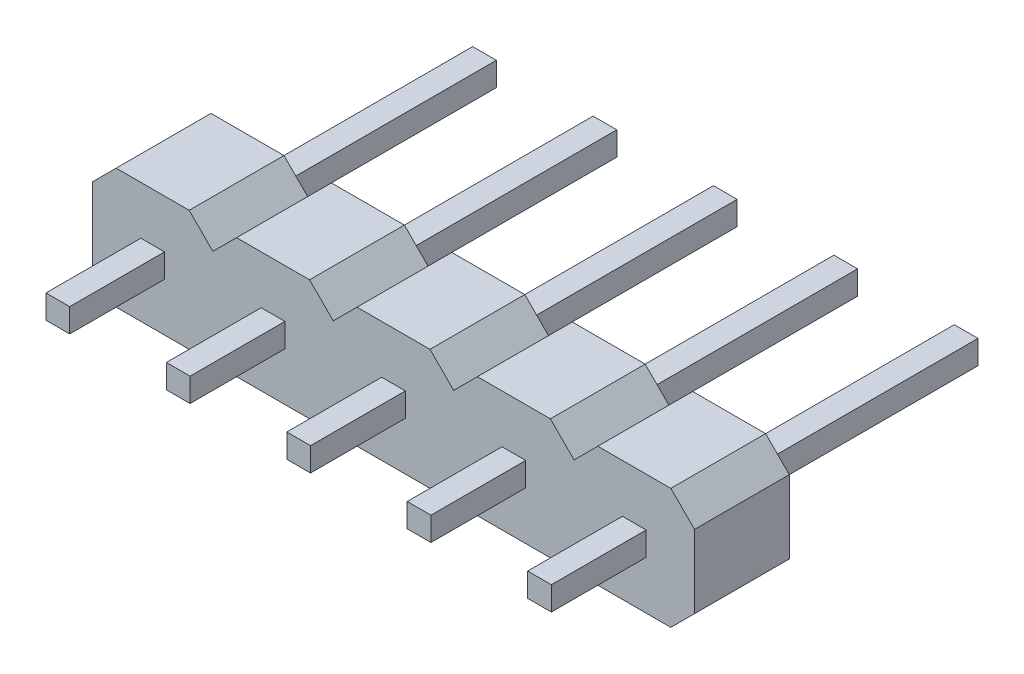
ISO-10303-21;
HEADER;
FILE_DESCRIPTION(('STEP AP214'),'2;1');
FILE_NAME('part.step','',(''),(''),'','','');
FILE_SCHEMA(('AUTOMOTIVE_DESIGN { 1 0 10303 214 1 1 1 1 }'));
ENDSEC;
DATA;
#1=APPLICATION_CONTEXT('core data for automotive mechanical design processes');
#2=APPLICATION_PROTOCOL_DEFINITION('international standard','automotive_design',2000,#1);
#3=PRODUCT_CONTEXT('',#1,'mechanical');
#4=PRODUCT('Part','Part','',(#3));
#5=PRODUCT_RELATED_PRODUCT_CATEGORY('part','',(#4));
#6=PRODUCT_DEFINITION_FORMATION('','',#4);
#7=PRODUCT_DEFINITION_CONTEXT('part definition',#1,'design');
#8=PRODUCT_DEFINITION('design','',#6,#7);
#9=PRODUCT_DEFINITION_SHAPE('','',#8);
#10=(LENGTH_UNIT() NAMED_UNIT(*) SI_UNIT(.MILLI.,.METRE.));
#11=(NAMED_UNIT(*) PLANE_ANGLE_UNIT() SI_UNIT($,.RADIAN.));
#12=(NAMED_UNIT(*) SI_UNIT($,.STERADIAN.) SOLID_ANGLE_UNIT());
#13=UNCERTAINTY_MEASURE_WITH_UNIT(LENGTH_MEASURE(1.E-05),#10,'distance_accuracy_value','');
#14=(GEOMETRIC_REPRESENTATION_CONTEXT(3) GLOBAL_UNCERTAINTY_ASSIGNED_CONTEXT((#13)) GLOBAL_UNIT_ASSIGNED_CONTEXT((#10,
#11,#12)) REPRESENTATION_CONTEXT('',''));
#15=CARTESIAN_POINT('',(0.,0.,0.));
#16=DIRECTION('',(0.,0.,1.));
#17=DIRECTION('',(1.,0.,0.));
#18=AXIS2_PLACEMENT_3D('',#15,#16,#17);
#19=CARTESIAN_POINT('',(-8.06000000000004,-8.06000000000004,2.));
#20=DIRECTION('',(-0.707106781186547,-0.707106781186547,0.));
#21=DIRECTION('',(0.707106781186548,-0.707106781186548,0.));
#22=AXIS2_PLACEMENT_3D('',#19,#20,#21);
#23=PLANE('',#22);
#24=DIRECTION('',(-0.707106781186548,0.707106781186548,0.));
#25=VECTOR('',#24,1.);
#26=CARTESIAN_POINT('',(-8.06000000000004,-8.06000000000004,0.));
#27=LINE('',#26,#25);
#28=CARTESIAN_POINT('',(-18.16,2.03999999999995,0.));
#29=VERTEX_POINT('',#28);
#30=CARTESIAN_POINT('',(-18.66,2.53999999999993,0.));
#31=VERTEX_POINT('',#30);
#32=EDGE_CURVE('E911',#29,#31,#27,.T.);
#33=ORIENTED_EDGE('',*,*,#32,.T.);
#34=DIRECTION('',(0.,0.,-1.));
#35=VECTOR('',#34,1.);
#36=CARTESIAN_POINT('',(-18.66,2.53999999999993,2.));
#37=LINE('',#36,#35);
#38=CARTESIAN_POINT('',(-18.66,2.53999999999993,2.));
#39=VERTEX_POINT('',#38);
#40=EDGE_CURVE('E1035',#39,#31,#37,.T.);
#41=ORIENTED_EDGE('',*,*,#40,.F.);
#42=DIRECTION('',(-0.707106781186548,0.707106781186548,0.));
#43=VECTOR('',#42,1.);
#44=CARTESIAN_POINT('',(-8.06000000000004,-8.06000000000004,2.));
#45=LINE('',#44,#43);
#46=CARTESIAN_POINT('',(-18.16,2.03999999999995,2.));
#47=VERTEX_POINT('',#46);
#48=EDGE_CURVE('E845',#47,#39,#45,.T.);
#49=ORIENTED_EDGE('',*,*,#48,.F.);
#50=DIRECTION('',(0.,0.,-1.));
#51=VECTOR('',#50,1.);
#52=CARTESIAN_POINT('',(-18.16,2.03999999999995,2.));
#53=LINE('',#52,#51);
#54=EDGE_CURVE('E910',#47,#29,#53,.T.);
#55=ORIENTED_EDGE('',*,*,#54,.T.);
#56=EDGE_LOOP('',(#33,#41,#49,#55));
#57=FACE_BOUND('',#56,.T.);
#58=ADVANCED_FACE('F136',(#57),#23,.F.);
#59=CARTESIAN_POINT('',(0.,2.53999999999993,2.));
#60=DIRECTION('',(0.,-1.,0.));
#61=DIRECTION('',(0.,0.,-1.));
#62=AXIS2_PLACEMENT_3D('',#59,#60,#61);
#63=PLANE('',#62);
#64=DIRECTION('',(-1.,0.,0.));
#65=VECTOR('',#64,1.);
#66=CARTESIAN_POINT('',(0.,2.53999999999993,0.));
#67=LINE('',#66,#65);
#68=CARTESIAN_POINT('',(-20.2,2.53999999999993,0.));
#69=VERTEX_POINT('',#68);
#70=EDGE_CURVE('E914',#31,#69,#67,.T.);
#71=ORIENTED_EDGE('',*,*,#70,.T.);
#72=DIRECTION('',(0.,0.,-1.));
#73=VECTOR('',#72,1.);
#74=CARTESIAN_POINT('',(-20.2,2.53999999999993,2.));
#75=LINE('',#74,#73);
#76=CARTESIAN_POINT('',(-20.2,2.53999999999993,2.));
#77=VERTEX_POINT('',#76);
#78=EDGE_CURVE('E1032',#77,#69,#75,.T.);
#79=ORIENTED_EDGE('',*,*,#78,.F.);
#80=DIRECTION('',(-1.,0.,0.));
#81=VECTOR('',#80,1.);
#82=CARTESIAN_POINT('',(0.,2.53999999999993,2.));
#83=LINE('',#82,#81);
#84=EDGE_CURVE('E848',#39,#77,#83,.T.);
#85=ORIENTED_EDGE('',*,*,#84,.F.);
#86=ORIENTED_EDGE('',*,*,#40,.T.);
#87=EDGE_LOOP('',(#71,#79,#85,#86));
#88=FACE_BOUND('',#87,.T.);
#89=ADVANCED_FACE('F1261',(#88),#63,.F.);
#90=CARTESIAN_POINT('',(-11.37,11.37,2.));
#91=DIRECTION('',(0.707106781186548,-0.707106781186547,0.));
#92=DIRECTION('',(0.707106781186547,0.707106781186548,0.));
#93=AXIS2_PLACEMENT_3D('',#90,#91,#92);
#94=PLANE('',#93);
#95=DIRECTION('',(-0.707106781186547,-0.707106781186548,0.));
#96=VECTOR('',#95,1.);
#97=CARTESIAN_POINT('',(-11.37,11.37,0.));
#98=LINE('',#97,#96);
#99=CARTESIAN_POINT('',(-20.7,2.03999999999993,0.));
#100=VERTEX_POINT('',#99);
#101=EDGE_CURVE('E917',#69,#100,#98,.T.);
#102=ORIENTED_EDGE('',*,*,#101,.T.);
#103=DIRECTION('',(0.,0.,-1.));
#104=VECTOR('',#103,1.);
#105=CARTESIAN_POINT('',(-20.7,2.03999999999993,2.));
#106=LINE('',#105,#104);
#107=CARTESIAN_POINT('',(-20.7,2.03999999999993,2.));
#108=VERTEX_POINT('',#107);
#109=EDGE_CURVE('E1030',#108,#100,#106,.T.);
#110=ORIENTED_EDGE('',*,*,#109,.F.);
#111=DIRECTION('',(-0.707106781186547,-0.707106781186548,0.));
#112=VECTOR('',#111,1.);
#113=CARTESIAN_POINT('',(-11.37,11.37,2.));
#114=LINE('',#113,#112);
#115=EDGE_CURVE('E851',#77,#108,#114,.T.);
#116=ORIENTED_EDGE('',*,*,#115,.F.);
#117=ORIENTED_EDGE('',*,*,#78,.T.);
#118=EDGE_LOOP('',(#102,#110,#116,#117));
#119=FACE_BOUND('',#118,.T.);
#120=ADVANCED_FACE('F1256',(#119),#94,.F.);
#121=CARTESIAN_POINT('',(-20.7,0.,2.));
#122=DIRECTION('',(-1.,0.,0.));
#123=DIRECTION('',(0.,0.,1.));
#124=AXIS2_PLACEMENT_3D('',#121,#122,#123);
#125=PLANE('',#124);
#126=DIRECTION('',(0.,1.,0.));
#127=VECTOR('',#126,1.);
#128=CARTESIAN_POINT('',(-20.7,0.,0.));
#129=LINE('',#128,#127);
#130=CARTESIAN_POINT('',(-20.7,0.499999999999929,0.));
#131=VERTEX_POINT('',#130);
#132=EDGE_CURVE('E920',#131,#100,#129,.T.);
#133=ORIENTED_EDGE('',*,*,#132,.F.);
#134=DIRECTION('',(0.,0.,-1.));
#135=VECTOR('',#134,1.);
#136=CARTESIAN_POINT('',(-20.7,0.499999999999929,2.));
#137=LINE('',#136,#135);
#138=CARTESIAN_POINT('',(-20.7,0.499999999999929,2.));
#139=VERTEX_POINT('',#138);
#140=EDGE_CURVE('E1028',#139,#131,#137,.T.);
#141=ORIENTED_EDGE('',*,*,#140,.F.);
#142=DIRECTION('',(0.,1.,0.));
#143=VECTOR('',#142,1.);
#144=CARTESIAN_POINT('',(-20.7,0.,2.));
#145=LINE('',#144,#143);
#146=EDGE_CURVE('E853',#139,#108,#145,.T.);
#147=ORIENTED_EDGE('',*,*,#146,.T.);
#148=ORIENTED_EDGE('',*,*,#109,.T.);
#149=EDGE_LOOP('',(#133,#141,#147,#148));
#150=FACE_BOUND('',#149,.T.);
#151=ADVANCED_FACE('F1252',(#150),#125,.T.);
#152=CARTESIAN_POINT('',(-10.1,-10.1,2.));
#153=DIRECTION('',(-0.707106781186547,-0.707106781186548,0.));
#154=DIRECTION('',(0.707106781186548,-0.707106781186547,0.));
#155=AXIS2_PLACEMENT_3D('',#152,#153,#154);
#156=PLANE('',#155);
#157=DIRECTION('',(-0.707106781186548,0.707106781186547,0.));
#158=VECTOR('',#157,1.);
#159=CARTESIAN_POINT('',(-10.1,-10.1,0.));
#160=LINE('',#159,#158);
#161=CARTESIAN_POINT('',(-20.2,0.,0.));
#162=VERTEX_POINT('',#161);
#163=EDGE_CURVE('E923',#162,#131,#160,.T.);
#164=ORIENTED_EDGE('',*,*,#163,.F.);
#165=DIRECTION('',(0.,0.,-1.));
#166=VECTOR('',#165,1.);
#167=CARTESIAN_POINT('',(-20.2,0.,2.));
#168=LINE('',#167,#166);
#169=CARTESIAN_POINT('',(-20.2,0.,2.));
#170=VERTEX_POINT('',#169);
#171=EDGE_CURVE('E1026',#170,#162,#168,.T.);
#172=ORIENTED_EDGE('',*,*,#171,.F.);
#173=DIRECTION('',(-0.707106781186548,0.707106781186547,0.));
#174=VECTOR('',#173,1.);
#175=CARTESIAN_POINT('',(-10.1,-10.1,2.));
#176=LINE('',#175,#174);
#177=EDGE_CURVE('E856',#170,#139,#176,.T.);
#178=ORIENTED_EDGE('',*,*,#177,.T.);
#179=ORIENTED_EDGE('',*,*,#140,.T.);
#180=EDGE_LOOP('',(#164,#172,#178,#179));
#181=FACE_BOUND('',#180,.T.);
#182=ADVANCED_FACE('F1248',(#181),#156,.T.);
#183=CARTESIAN_POINT('',(0.,0.,2.));
#184=DIRECTION('',(0.,-1.,0.));
#185=DIRECTION('',(1.,0.,0.));
#186=AXIS2_PLACEMENT_3D('',#183,#184,#185);
#187=PLANE('',#186);
#188=DIRECTION('',(-1.,0.,0.));
#189=VECTOR('',#188,1.);
#190=CARTESIAN_POINT('',(0.,0.,0.));
#191=LINE('',#190,#189);
#192=CARTESIAN_POINT('',(-18.66,0.,0.));
#193=VERTEX_POINT('',#192);
#194=EDGE_CURVE('E926',#193,#162,#191,.T.);
#195=ORIENTED_EDGE('',*,*,#194,.F.);
#196=DIRECTION('',(0.,0.,-1.));
#197=VECTOR('',#196,1.);
#198=CARTESIAN_POINT('',(-18.66,0.,2.));
#199=LINE('',#198,#197);
#200=CARTESIAN_POINT('',(-18.66,0.,2.));
#201=VERTEX_POINT('',#200);
#202=EDGE_CURVE('E1024',#201,#193,#199,.T.);
#203=ORIENTED_EDGE('',*,*,#202,.F.);
#204=DIRECTION('',(-1.,0.,0.));
#205=VECTOR('',#204,1.);
#206=CARTESIAN_POINT('',(0.,0.,2.));
#207=LINE('',#206,#205);
#208=EDGE_CURVE('E859',#201,#170,#207,.T.);
#209=ORIENTED_EDGE('',*,*,#208,.T.);
#210=ORIENTED_EDGE('',*,*,#171,.T.);
#211=EDGE_LOOP('',(#195,#203,#209,#210));
#212=FACE_BOUND('',#211,.T.);
#213=ADVANCED_FACE('F1243',(#212),#187,.T.);
#214=CARTESIAN_POINT('',(-9.32999999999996,9.32999999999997,2.));
#215=DIRECTION('',(0.707106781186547,-0.707106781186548,0.));
#216=DIRECTION('',(0.707106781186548,0.707106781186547,0.));
#217=AXIS2_PLACEMENT_3D('',#214,#215,#216);
#218=PLANE('',#217);
#219=DIRECTION('',(-0.707106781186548,-0.707106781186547,0.));
#220=VECTOR('',#219,1.);
#221=CARTESIAN_POINT('',(-9.32999999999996,9.32999999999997,0.));
#222=LINE('',#221,#220);
#223=CARTESIAN_POINT('',(-18.16,0.499999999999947,0.));
#224=VERTEX_POINT('',#223);
#225=EDGE_CURVE('E929',#224,#193,#222,.T.);
#226=ORIENTED_EDGE('',*,*,#225,.F.);
#227=DIRECTION('',(0.,0.,-1.));
#228=VECTOR('',#227,1.);
#229=CARTESIAN_POINT('',(-18.16,0.499999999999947,2.));
#230=LINE('',#229,#228);
#231=CARTESIAN_POINT('',(-18.16,0.499999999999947,2.));
#232=VERTEX_POINT('',#231);
#233=EDGE_CURVE('E1022',#232,#224,#230,.T.);
#234=ORIENTED_EDGE('',*,*,#233,.F.);
#235=DIRECTION('',(-0.707106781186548,-0.707106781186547,0.));
#236=VECTOR('',#235,1.);
#237=CARTESIAN_POINT('',(-9.32999999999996,9.32999999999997,2.));
#238=LINE('',#237,#236);
#239=EDGE_CURVE('E862',#232,#201,#238,.T.);
#240=ORIENTED_EDGE('',*,*,#239,.T.);
#241=ORIENTED_EDGE('',*,*,#202,.T.);
#242=EDGE_LOOP('',(#226,#234,#240,#241));
#243=FACE_BOUND('',#242,.T.);
#244=ADVANCED_FACE('F1239',(#243),#218,.T.);
#245=CARTESIAN_POINT('',(-8.83000000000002,-8.83000000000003,2.));
#246=DIRECTION('',(-0.707106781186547,-0.707106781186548,0.));
#247=DIRECTION('',(0.707106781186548,-0.707106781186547,0.));
#248=AXIS2_PLACEMENT_3D('',#245,#246,#247);
#249=PLANE('',#248);
#250=DIRECTION('',(-0.707106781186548,0.707106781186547,0.));
#251=VECTOR('',#250,1.);
#252=CARTESIAN_POINT('',(-8.83000000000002,-8.83000000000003,0.));
#253=LINE('',#252,#251);
#254=CARTESIAN_POINT('',(-17.66,0.,0.));
#255=VERTEX_POINT('',#254);
#256=EDGE_CURVE('E932',#255,#224,#253,.T.);
#257=ORIENTED_EDGE('',*,*,#256,.F.);
#258=DIRECTION('',(0.,0.,-1.));
#259=VECTOR('',#258,1.);
#260=CARTESIAN_POINT('',(-17.66,0.,2.));
#261=LINE('',#260,#259);
#262=CARTESIAN_POINT('',(-17.66,0.,2.));
#263=VERTEX_POINT('',#262);
#264=EDGE_CURVE('E1020',#263,#255,#261,.T.);
#265=ORIENTED_EDGE('',*,*,#264,.F.);
#266=DIRECTION('',(-0.707106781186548,0.707106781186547,0.));
#267=VECTOR('',#266,1.);
#268=CARTESIAN_POINT('',(-8.83000000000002,-8.83000000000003,2.));
#269=LINE('',#268,#267);
#270=EDGE_CURVE('E865',#263,#232,#269,.T.);
#271=ORIENTED_EDGE('',*,*,#270,.T.);
#272=ORIENTED_EDGE('',*,*,#233,.T.);
#273=EDGE_LOOP('',(#257,#265,#271,#272));
#274=FACE_BOUND('',#273,.T.);
#275=ADVANCED_FACE('F1235',(#274),#249,.T.);
#276=CARTESIAN_POINT('',(0.,0.,2.));
#277=DIRECTION('',(0.,-1.,0.));
#278=DIRECTION('',(1.,0.,0.));
#279=AXIS2_PLACEMENT_3D('',#276,#277,#278);
#280=PLANE('',#279);
#281=DIRECTION('',(-1.,0.,0.));
#282=VECTOR('',#281,1.);
#283=CARTESIAN_POINT('',(0.,0.,0.));
#284=LINE('',#283,#282);
#285=CARTESIAN_POINT('',(-16.12,0.,0.));
#286=VERTEX_POINT('',#285);
#287=EDGE_CURVE('E935',#286,#255,#284,.T.);
#288=ORIENTED_EDGE('',*,*,#287,.F.);
#289=DIRECTION('',(0.,0.,-1.));
#290=VECTOR('',#289,1.);
#291=CARTESIAN_POINT('',(-16.12,0.,2.));
#292=LINE('',#291,#290);
#293=CARTESIAN_POINT('',(-16.12,0.,2.));
#294=VERTEX_POINT('',#293);
#295=EDGE_CURVE('E1018',#294,#286,#292,.T.);
#296=ORIENTED_EDGE('',*,*,#295,.F.);
#297=DIRECTION('',(-1.,0.,0.));
#298=VECTOR('',#297,1.);
#299=CARTESIAN_POINT('',(0.,0.,2.));
#300=LINE('',#299,#298);
#301=EDGE_CURVE('E868',#294,#263,#300,.T.);
#302=ORIENTED_EDGE('',*,*,#301,.T.);
#303=ORIENTED_EDGE('',*,*,#264,.T.);
#304=EDGE_LOOP('',(#288,#296,#302,#303));
#305=FACE_BOUND('',#304,.T.);
#306=ADVANCED_FACE('F1231',(#305),#280,.T.);
#307=CARTESIAN_POINT('',(-8.05999999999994,8.05999999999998,2.));
#308=DIRECTION('',(0.707106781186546,-0.707106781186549,0.));
#309=DIRECTION('',(0.707106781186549,0.707106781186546,0.));
#310=AXIS2_PLACEMENT_3D('',#307,#308,#309);
#311=PLANE('',#310);
#312=DIRECTION('',(-0.707106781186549,-0.707106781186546,0.));
#313=VECTOR('',#312,1.);
#314=CARTESIAN_POINT('',(-8.05999999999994,8.05999999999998,0.));
#315=LINE('',#314,#313);
#316=CARTESIAN_POINT('',(-15.62,0.499999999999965,0.));
#317=VERTEX_POINT('',#316);
#318=EDGE_CURVE('E938',#317,#286,#315,.T.);
#319=ORIENTED_EDGE('',*,*,#318,.F.);
#320=DIRECTION('',(0.,0.,-1.));
#321=VECTOR('',#320,1.);
#322=CARTESIAN_POINT('',(-15.62,0.499999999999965,2.));
#323=LINE('',#322,#321);
#324=CARTESIAN_POINT('',(-15.62,0.499999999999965,2.));
#325=VERTEX_POINT('',#324);
#326=EDGE_CURVE('E1016',#325,#317,#323,.T.);
#327=ORIENTED_EDGE('',*,*,#326,.F.);
#328=DIRECTION('',(-0.707106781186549,-0.707106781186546,0.));
#329=VECTOR('',#328,1.);
#330=CARTESIAN_POINT('',(-8.05999999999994,8.05999999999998,2.));
#331=LINE('',#330,#329);
#332=EDGE_CURVE('E871',#325,#294,#331,.T.);
#333=ORIENTED_EDGE('',*,*,#332,.T.);
#334=ORIENTED_EDGE('',*,*,#295,.T.);
#335=EDGE_LOOP('',(#319,#327,#333,#334));
#336=FACE_BOUND('',#335,.T.);
#337=ADVANCED_FACE('F1227',(#336),#311,.T.);
#338=CARTESIAN_POINT('',(-7.56000000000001,-7.56000000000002,2.));
#339=DIRECTION('',(-0.707106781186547,-0.707106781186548,0.));
#340=DIRECTION('',(0.707106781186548,-0.707106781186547,0.));
#341=AXIS2_PLACEMENT_3D('',#338,#339,#340);
#342=PLANE('',#341);
#343=DIRECTION('',(-0.707106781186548,0.707106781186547,0.));
#344=VECTOR('',#343,1.);
#345=CARTESIAN_POINT('',(-7.56000000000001,-7.56000000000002,0.));
#346=LINE('',#345,#344);
#347=CARTESIAN_POINT('',(-15.12,0.,0.));
#348=VERTEX_POINT('',#347);
#349=EDGE_CURVE('E941',#348,#317,#346,.T.);
#350=ORIENTED_EDGE('',*,*,#349,.F.);
#351=DIRECTION('',(0.,0.,-1.));
#352=VECTOR('',#351,1.);
#353=CARTESIAN_POINT('',(-15.12,0.,2.));
#354=LINE('',#353,#352);
#355=CARTESIAN_POINT('',(-15.12,0.,2.));
#356=VERTEX_POINT('',#355);
#357=EDGE_CURVE('E1014',#356,#348,#354,.T.);
#358=ORIENTED_EDGE('',*,*,#357,.F.);
#359=DIRECTION('',(-0.707106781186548,0.707106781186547,0.));
#360=VECTOR('',#359,1.);
#361=CARTESIAN_POINT('',(-7.56000000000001,-7.56000000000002,2.));
#362=LINE('',#361,#360);
#363=EDGE_CURVE('E874',#356,#325,#362,.T.);
#364=ORIENTED_EDGE('',*,*,#363,.T.);
#365=ORIENTED_EDGE('',*,*,#326,.T.);
#366=EDGE_LOOP('',(#350,#358,#364,#365));
#367=FACE_BOUND('',#366,.T.);
#368=ADVANCED_FACE('F1223',(#367),#342,.T.);
#369=CARTESIAN_POINT('',(0.,0.,2.));
#370=DIRECTION('',(0.,-1.,0.));
#371=DIRECTION('',(1.,0.,0.));
#372=AXIS2_PLACEMENT_3D('',#369,#370,#371);
#373=PLANE('',#372);
#374=DIRECTION('',(-1.,0.,0.));
#375=VECTOR('',#374,1.);
#376=CARTESIAN_POINT('',(0.,0.,0.));
#377=LINE('',#376,#375);
#378=CARTESIAN_POINT('',(-13.58,0.,0.));
#379=VERTEX_POINT('',#378);
#380=EDGE_CURVE('E944',#379,#348,#377,.T.);
#381=ORIENTED_EDGE('',*,*,#380,.F.);
#382=DIRECTION('',(0.,0.,-1.));
#383=VECTOR('',#382,1.);
#384=CARTESIAN_POINT('',(-13.58,0.,2.));
#385=LINE('',#384,#383);
#386=CARTESIAN_POINT('',(-13.58,0.,2.));
#387=VERTEX_POINT('',#386);
#388=EDGE_CURVE('E1012',#387,#379,#385,.T.);
#389=ORIENTED_EDGE('',*,*,#388,.F.);
#390=DIRECTION('',(-1.,0.,0.));
#391=VECTOR('',#390,1.);
#392=CARTESIAN_POINT('',(0.,0.,2.));
#393=LINE('',#392,#391);
#394=EDGE_CURVE('E877',#387,#356,#393,.T.);
#395=ORIENTED_EDGE('',*,*,#394,.T.);
#396=ORIENTED_EDGE('',*,*,#357,.T.);
#397=EDGE_LOOP('',(#381,#389,#395,#396));
#398=FACE_BOUND('',#397,.T.);
#399=ADVANCED_FACE('F1219',(#398),#373,.T.);
#400=CARTESIAN_POINT('',(-6.78999999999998,6.78999999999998,2.));
#401=DIRECTION('',(0.707106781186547,-0.707106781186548,0.));
#402=DIRECTION('',(0.707106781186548,0.707106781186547,0.));
#403=AXIS2_PLACEMENT_3D('',#400,#401,#402);
#404=PLANE('',#403);
#405=DIRECTION('',(-0.707106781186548,-0.707106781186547,0.));
#406=VECTOR('',#405,1.);
#407=CARTESIAN_POINT('',(-6.78999999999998,6.78999999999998,0.));
#408=LINE('',#407,#406);
#409=CARTESIAN_POINT('',(-13.08,0.499999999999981,0.));
#410=VERTEX_POINT('',#409);
#411=EDGE_CURVE('E947',#410,#379,#408,.T.);
#412=ORIENTED_EDGE('',*,*,#411,.F.);
#413=DIRECTION('',(0.,0.,-1.));
#414=VECTOR('',#413,1.);
#415=CARTESIAN_POINT('',(-13.08,0.499999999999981,2.));
#416=LINE('',#415,#414);
#417=CARTESIAN_POINT('',(-13.08,0.499999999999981,2.));
#418=VERTEX_POINT('',#417);
#419=EDGE_CURVE('E1010',#418,#410,#416,.T.);
#420=ORIENTED_EDGE('',*,*,#419,.F.);
#421=DIRECTION('',(-0.707106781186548,-0.707106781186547,0.));
#422=VECTOR('',#421,1.);
#423=CARTESIAN_POINT('',(-6.78999999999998,6.78999999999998,2.));
#424=LINE('',#423,#422);
#425=EDGE_CURVE('E880',#418,#387,#424,.T.);
#426=ORIENTED_EDGE('',*,*,#425,.T.);
#427=ORIENTED_EDGE('',*,*,#388,.T.);
#428=EDGE_LOOP('',(#412,#420,#426,#427));
#429=FACE_BOUND('',#428,.T.);
#430=ADVANCED_FACE('F1215',(#429),#404,.T.);
#431=CARTESIAN_POINT('',(-6.29,-6.29000000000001,2.));
#432=DIRECTION('',(-0.707106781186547,-0.707106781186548,0.));
#433=DIRECTION('',(0.707106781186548,-0.707106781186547,0.));
#434=AXIS2_PLACEMENT_3D('',#431,#432,#433);
#435=PLANE('',#434);
#436=DIRECTION('',(-0.707106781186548,0.707106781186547,0.));
#437=VECTOR('',#436,1.);
#438=CARTESIAN_POINT('',(-6.29,-6.29000000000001,0.));
#439=LINE('',#438,#437);
#440=CARTESIAN_POINT('',(-12.58,0.,0.));
#441=VERTEX_POINT('',#440);
#442=EDGE_CURVE('E950',#441,#410,#439,.T.);
#443=ORIENTED_EDGE('',*,*,#442,.F.);
#444=DIRECTION('',(0.,0.,-1.));
#445=VECTOR('',#444,1.);
#446=CARTESIAN_POINT('',(-12.58,0.,2.));
#447=LINE('',#446,#445);
#448=CARTESIAN_POINT('',(-12.58,0.,2.));
#449=VERTEX_POINT('',#448);
#450=EDGE_CURVE('E1008',#449,#441,#447,.T.);
#451=ORIENTED_EDGE('',*,*,#450,.F.);
#452=DIRECTION('',(-0.707106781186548,0.707106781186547,0.));
#453=VECTOR('',#452,1.);
#454=CARTESIAN_POINT('',(-6.29,-6.29000000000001,2.));
#455=LINE('',#454,#453);
#456=EDGE_CURVE('E883',#449,#418,#455,.T.);
#457=ORIENTED_EDGE('',*,*,#456,.T.);
#458=ORIENTED_EDGE('',*,*,#419,.T.);
#459=EDGE_LOOP('',(#443,#451,#457,#458));
#460=FACE_BOUND('',#459,.T.);
#461=ADVANCED_FACE('F1211',(#460),#435,.T.);
#462=CARTESIAN_POINT('',(0.,0.,2.));
#463=DIRECTION('',(0.,-1.,0.));
#464=DIRECTION('',(1.,0.,0.));
#465=AXIS2_PLACEMENT_3D('',#462,#463,#464);
#466=PLANE('',#465);
#467=DIRECTION('',(-1.,0.,0.));
#468=VECTOR('',#467,1.);
#469=CARTESIAN_POINT('',(0.,0.,0.));
#470=LINE('',#469,#468);
#471=CARTESIAN_POINT('',(-11.04,0.,0.));
#472=VERTEX_POINT('',#471);
#473=EDGE_CURVE('E953',#472,#441,#470,.T.);
#474=ORIENTED_EDGE('',*,*,#473,.F.);
#475=DIRECTION('',(0.,0.,-1.));
#476=VECTOR('',#475,1.);
#477=CARTESIAN_POINT('',(-11.04,0.,2.));
#478=LINE('',#477,#476);
#479=CARTESIAN_POINT('',(-11.04,0.,2.));
#480=VERTEX_POINT('',#479);
#481=EDGE_CURVE('E1006',#480,#472,#478,.T.);
#482=ORIENTED_EDGE('',*,*,#481,.F.);
#483=DIRECTION('',(-1.,0.,0.));
#484=VECTOR('',#483,1.);
#485=CARTESIAN_POINT('',(0.,0.,2.));
#486=LINE('',#485,#484);
#487=EDGE_CURVE('E886',#480,#449,#486,.T.);
#488=ORIENTED_EDGE('',*,*,#487,.T.);
#489=ORIENTED_EDGE('',*,*,#450,.T.);
#490=EDGE_LOOP('',(#474,#482,#488,#489));
#491=FACE_BOUND('',#490,.T.);
#492=ADVANCED_FACE('F1207',(#491),#466,.T.);
#493=CARTESIAN_POINT('',(-5.51999999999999,5.51999999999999,2.));
#494=DIRECTION('',(0.707106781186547,-0.707106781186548,0.));
#495=DIRECTION('',(0.707106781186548,0.707106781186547,0.));
#496=AXIS2_PLACEMENT_3D('',#493,#494,#495);
#497=PLANE('',#496);
#498=DIRECTION('',(-0.707106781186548,-0.707106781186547,0.));
#499=VECTOR('',#498,1.);
#500=CARTESIAN_POINT('',(-5.51999999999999,5.51999999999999,0.));
#501=LINE('',#500,#499);
#502=CARTESIAN_POINT('',(-10.54,0.499999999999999,0.));
#503=VERTEX_POINT('',#502);
#504=EDGE_CURVE('E956',#503,#472,#501,.T.);
#505=ORIENTED_EDGE('',*,*,#504,.F.);
#506=DIRECTION('',(0.,0.,-1.));
#507=VECTOR('',#506,1.);
#508=CARTESIAN_POINT('',(-10.54,0.499999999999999,2.));
#509=LINE('',#508,#507);
#510=CARTESIAN_POINT('',(-10.54,0.499999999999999,2.));
#511=VERTEX_POINT('',#510);
#512=EDGE_CURVE('E1004',#511,#503,#509,.T.);
#513=ORIENTED_EDGE('',*,*,#512,.F.);
#514=DIRECTION('',(-0.707106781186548,-0.707106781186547,0.));
#515=VECTOR('',#514,1.);
#516=CARTESIAN_POINT('',(-5.51999999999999,5.51999999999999,2.));
#517=LINE('',#516,#515);
#518=EDGE_CURVE('E889',#511,#480,#517,.T.);
#519=ORIENTED_EDGE('',*,*,#518,.T.);
#520=ORIENTED_EDGE('',*,*,#481,.T.);
#521=EDGE_LOOP('',(#505,#513,#519,#520));
#522=FACE_BOUND('',#521,.T.);
#523=ADVANCED_FACE('F1202',(#522),#497,.T.);
#524=CARTESIAN_POINT('',(-4.25000000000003,-4.25000000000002,2.));
#525=DIRECTION('',(-0.707106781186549,-0.707106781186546,0.));
#526=DIRECTION('',(0.707106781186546,-0.707106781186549,0.));
#527=AXIS2_PLACEMENT_3D('',#524,#525,#526);
#528=PLANE('',#527);
#529=DIRECTION('',(-0.707106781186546,0.707106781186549,0.));
#530=VECTOR('',#529,1.);
#531=CARTESIAN_POINT('',(-4.25000000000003,-4.25000000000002,0.));
#532=LINE('',#531,#530);
#533=CARTESIAN_POINT('',(-10.54,2.04,0.));
#534=VERTEX_POINT('',#533);
#535=CARTESIAN_POINT('',(-11.04,2.53999999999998,0.));
#536=VERTEX_POINT('',#535);
#537=EDGE_CURVE('E959',#534,#536,#532,.T.);
#538=ORIENTED_EDGE('',*,*,#537,.T.);
#539=DIRECTION('',(0.,0.,-1.));
#540=VECTOR('',#539,1.);
#541=CARTESIAN_POINT('',(-11.04,2.53999999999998,2.));
#542=LINE('',#541,#540);
#543=CARTESIAN_POINT('',(-11.04,2.53999999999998,2.));
#544=VERTEX_POINT('',#543);
#545=EDGE_CURVE('E999',#544,#536,#542,.T.);
#546=ORIENTED_EDGE('',*,*,#545,.F.);
#547=DIRECTION('',(-0.707106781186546,0.707106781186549,0.));
#548=VECTOR('',#547,1.);
#549=CARTESIAN_POINT('',(-4.25000000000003,-4.25000000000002,2.));
#550=LINE('',#549,#548);
#551=CARTESIAN_POINT('',(-10.54,2.04,2.));
#552=VERTEX_POINT('',#551);
#553=EDGE_CURVE('E892',#552,#544,#550,.T.);
#554=ORIENTED_EDGE('',*,*,#553,.F.);
#555=DIRECTION('',(0.,0.,-1.));
#556=VECTOR('',#555,1.);
#557=CARTESIAN_POINT('',(-10.54,2.04,2.));
#558=LINE('',#557,#556);
#559=EDGE_CURVE('E1002',#552,#534,#558,.T.);
#560=ORIENTED_EDGE('',*,*,#559,.T.);
#561=EDGE_LOOP('',(#538,#546,#554,#560));
#562=FACE_BOUND('',#561,.T.);
#563=ADVANCED_FACE('F1308',(#562),#528,.F.);
#564=CARTESIAN_POINT('',(0.,2.53999999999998,2.));
#565=DIRECTION('',(0.,-1.,0.));
#566=DIRECTION('',(0.,0.,-1.));
#567=AXIS2_PLACEMENT_3D('',#564,#565,#566);
#568=PLANE('',#567);
#569=DIRECTION('',(-1.,0.,0.));
#570=VECTOR('',#569,1.);
#571=CARTESIAN_POINT('',(0.,2.53999999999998,0.));
#572=LINE('',#571,#570);
#573=CARTESIAN_POINT('',(-12.58,2.53999999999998,0.));
#574=VERTEX_POINT('',#573);
#575=EDGE_CURVE('E961',#536,#574,#572,.T.);
#576=ORIENTED_EDGE('',*,*,#575,.T.);
#577=DIRECTION('',(0.,0.,-1.));
#578=VECTOR('',#577,1.);
#579=CARTESIAN_POINT('',(-12.58,2.53999999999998,2.));
#580=LINE('',#579,#578);
#581=CARTESIAN_POINT('',(-12.58,2.53999999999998,2.));
#582=VERTEX_POINT('',#581);
#583=EDGE_CURVE('E996',#582,#574,#580,.T.);
#584=ORIENTED_EDGE('',*,*,#583,.F.);
#585=DIRECTION('',(-1.,0.,0.));
#586=VECTOR('',#585,1.);
#587=CARTESIAN_POINT('',(0.,2.53999999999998,2.));
#588=LINE('',#587,#586);
#589=EDGE_CURVE('E894',#544,#582,#588,.T.);
#590=ORIENTED_EDGE('',*,*,#589,.F.);
#591=ORIENTED_EDGE('',*,*,#545,.T.);
#592=EDGE_LOOP('',(#576,#584,#590,#591));
#593=FACE_BOUND('',#592,.T.);
#594=ADVANCED_FACE('F1303',(#593),#568,.F.);
#595=CARTESIAN_POINT('',(-7.56,7.55999999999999,2.));
#596=DIRECTION('',(0.707106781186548,-0.707106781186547,0.));
#597=DIRECTION('',(0.707106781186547,0.707106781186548,0.));
#598=AXIS2_PLACEMENT_3D('',#595,#596,#597);
#599=PLANE('',#598);
#600=DIRECTION('',(-0.707106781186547,-0.707106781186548,0.));
#601=VECTOR('',#600,1.);
#602=CARTESIAN_POINT('',(-7.56,7.55999999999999,0.));
#603=LINE('',#602,#601);
#604=CARTESIAN_POINT('',(-13.08,2.03999999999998,0.));
#605=VERTEX_POINT('',#604);
#606=EDGE_CURVE('E963',#574,#605,#603,.T.);
#607=ORIENTED_EDGE('',*,*,#606,.T.);
#608=DIRECTION('',(0.,0.,-1.));
#609=VECTOR('',#608,1.);
#610=CARTESIAN_POINT('',(-13.08,2.03999999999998,2.));
#611=LINE('',#610,#609);
#612=CARTESIAN_POINT('',(-13.08,2.03999999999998,2.));
#613=VERTEX_POINT('',#612);
#614=EDGE_CURVE('E993',#613,#605,#611,.T.);
#615=ORIENTED_EDGE('',*,*,#614,.F.);
#616=DIRECTION('',(-0.707106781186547,-0.707106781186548,0.));
#617=VECTOR('',#616,1.);
#618=CARTESIAN_POINT('',(-7.56,7.55999999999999,2.));
#619=LINE('',#618,#617);
#620=EDGE_CURVE('E896',#582,#613,#619,.T.);
#621=ORIENTED_EDGE('',*,*,#620,.F.);
#622=ORIENTED_EDGE('',*,*,#583,.T.);
#623=EDGE_LOOP('',(#607,#615,#621,#622));
#624=FACE_BOUND('',#623,.T.);
#625=ADVANCED_FACE('F1297',(#624),#599,.F.);
#626=CARTESIAN_POINT('',(-5.52000000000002,-5.52000000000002,2.));
#627=DIRECTION('',(-0.707106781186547,-0.707106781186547,0.));
#628=DIRECTION('',(0.707106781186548,-0.707106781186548,0.));
#629=AXIS2_PLACEMENT_3D('',#626,#627,#628);
#630=PLANE('',#629);
#631=DIRECTION('',(-0.707106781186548,0.707106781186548,0.));
#632=VECTOR('',#631,1.);
#633=CARTESIAN_POINT('',(-5.52000000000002,-5.52000000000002,0.));
#634=LINE('',#633,#632);
#635=CARTESIAN_POINT('',(-13.58,2.53999999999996,0.));
#636=VERTEX_POINT('',#635);
#637=EDGE_CURVE('E965',#605,#636,#634,.T.);
#638=ORIENTED_EDGE('',*,*,#637,.T.);
#639=DIRECTION('',(0.,0.,-1.));
#640=VECTOR('',#639,1.);
#641=CARTESIAN_POINT('',(-13.58,2.53999999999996,2.));
#642=LINE('',#641,#640);
#643=CARTESIAN_POINT('',(-13.58,2.53999999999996,2.));
#644=VERTEX_POINT('',#643);
#645=EDGE_CURVE('E990',#644,#636,#642,.T.);
#646=ORIENTED_EDGE('',*,*,#645,.F.);
#647=DIRECTION('',(-0.707106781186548,0.707106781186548,0.));
#648=VECTOR('',#647,1.);
#649=CARTESIAN_POINT('',(-5.52000000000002,-5.52000000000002,2.));
#650=LINE('',#649,#648);
#651=EDGE_CURVE('E898',#613,#644,#650,.T.);
#652=ORIENTED_EDGE('',*,*,#651,.F.);
#653=ORIENTED_EDGE('',*,*,#614,.T.);
#654=EDGE_LOOP('',(#638,#646,#652,#653));
#655=FACE_BOUND('',#654,.T.);
#656=ADVANCED_FACE('F1293',(#655),#630,.F.);
#657=CARTESIAN_POINT('',(0.,2.53999999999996,2.));
#658=DIRECTION('',(0.,-1.,0.));
#659=DIRECTION('',(0.,0.,-1.));
#660=AXIS2_PLACEMENT_3D('',#657,#658,#659);
#661=PLANE('',#660);
#662=DIRECTION('',(-1.,0.,0.));
#663=VECTOR('',#662,1.);
#664=CARTESIAN_POINT('',(0.,2.53999999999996,0.));
#665=LINE('',#664,#663);
#666=CARTESIAN_POINT('',(-15.12,2.53999999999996,0.));
#667=VERTEX_POINT('',#666);
#668=EDGE_CURVE('E967',#636,#667,#665,.T.);
#669=ORIENTED_EDGE('',*,*,#668,.T.);
#670=DIRECTION('',(0.,0.,-1.));
#671=VECTOR('',#670,1.);
#672=CARTESIAN_POINT('',(-15.12,2.53999999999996,2.));
#673=LINE('',#672,#671);
#674=CARTESIAN_POINT('',(-15.12,2.53999999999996,2.));
#675=VERTEX_POINT('',#674);
#676=EDGE_CURVE('E987',#675,#667,#673,.T.);
#677=ORIENTED_EDGE('',*,*,#676,.F.);
#678=DIRECTION('',(-1.,0.,0.));
#679=VECTOR('',#678,1.);
#680=CARTESIAN_POINT('',(0.,2.53999999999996,2.));
#681=LINE('',#680,#679);
#682=EDGE_CURVE('E900',#644,#675,#681,.T.);
#683=ORIENTED_EDGE('',*,*,#682,.F.);
#684=ORIENTED_EDGE('',*,*,#645,.T.);
#685=EDGE_LOOP('',(#669,#677,#683,#684));
#686=FACE_BOUND('',#685,.T.);
#687=ADVANCED_FACE('F1288',(#686),#661,.F.);
#688=CARTESIAN_POINT('',(-8.82999999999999,8.82999999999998,2.));
#689=DIRECTION('',(0.707106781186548,-0.707106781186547,0.));
#690=DIRECTION('',(0.707106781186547,0.707106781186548,0.));
#691=AXIS2_PLACEMENT_3D('',#688,#689,#690);
#692=PLANE('',#691);
#693=DIRECTION('',(-0.707106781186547,-0.707106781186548,0.));
#694=VECTOR('',#693,1.);
#695=CARTESIAN_POINT('',(-8.82999999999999,8.82999999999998,0.));
#696=LINE('',#695,#694);
#697=CARTESIAN_POINT('',(-15.62,2.03999999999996,0.));
#698=VERTEX_POINT('',#697);
#699=EDGE_CURVE('E969',#667,#698,#696,.T.);
#700=ORIENTED_EDGE('',*,*,#699,.T.);
#701=DIRECTION('',(0.,0.,-1.));
#702=VECTOR('',#701,1.);
#703=CARTESIAN_POINT('',(-15.62,2.03999999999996,2.));
#704=LINE('',#703,#702);
#705=CARTESIAN_POINT('',(-15.62,2.03999999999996,2.));
#706=VERTEX_POINT('',#705);
#707=EDGE_CURVE('E984',#706,#698,#704,.T.);
#708=ORIENTED_EDGE('',*,*,#707,.F.);
#709=DIRECTION('',(-0.707106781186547,-0.707106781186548,0.));
#710=VECTOR('',#709,1.);
#711=CARTESIAN_POINT('',(-8.82999999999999,8.82999999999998,2.));
#712=LINE('',#711,#710);
#713=EDGE_CURVE('E902',#675,#706,#712,.T.);
#714=ORIENTED_EDGE('',*,*,#713,.F.);
#715=ORIENTED_EDGE('',*,*,#676,.T.);
#716=EDGE_LOOP('',(#700,#708,#714,#715));
#717=FACE_BOUND('',#716,.T.);
#718=ADVANCED_FACE('F1282',(#717),#692,.F.);
#719=CARTESIAN_POINT('',(-6.79000000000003,-6.79000000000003,2.));
#720=DIRECTION('',(-0.707106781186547,-0.707106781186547,0.));
#721=DIRECTION('',(0.707106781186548,-0.707106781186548,0.));
#722=AXIS2_PLACEMENT_3D('',#719,#720,#721);
#723=PLANE('',#722);
#724=DIRECTION('',(-0.707106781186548,0.707106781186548,0.));
#725=VECTOR('',#724,1.);
#726=CARTESIAN_POINT('',(-6.79000000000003,-6.79000000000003,0.));
#727=LINE('',#726,#725);
#728=CARTESIAN_POINT('',(-16.12,2.53999999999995,0.));
#729=VERTEX_POINT('',#728);
#730=EDGE_CURVE('E971',#698,#729,#727,.T.);
#731=ORIENTED_EDGE('',*,*,#730,.T.);
#732=DIRECTION('',(0.,0.,-1.));
#733=VECTOR('',#732,1.);
#734=CARTESIAN_POINT('',(-16.12,2.53999999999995,2.));
#735=LINE('',#734,#733);
#736=CARTESIAN_POINT('',(-16.12,2.53999999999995,2.));
#737=VERTEX_POINT('',#736);
#738=EDGE_CURVE('E981',#737,#729,#735,.T.);
#739=ORIENTED_EDGE('',*,*,#738,.F.);
#740=DIRECTION('',(-0.707106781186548,0.707106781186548,0.));
#741=VECTOR('',#740,1.);
#742=CARTESIAN_POINT('',(-6.79000000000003,-6.79000000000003,2.));
#743=LINE('',#742,#741);
#744=EDGE_CURVE('E904',#706,#737,#743,.T.);
#745=ORIENTED_EDGE('',*,*,#744,.F.);
#746=ORIENTED_EDGE('',*,*,#707,.T.);
#747=EDGE_LOOP('',(#731,#739,#745,#746));
#748=FACE_BOUND('',#747,.T.);
#749=ADVANCED_FACE('F1278',(#748),#723,.F.);
#750=CARTESIAN_POINT('',(0.,2.53999999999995,2.));
#751=DIRECTION('',(0.,-1.,0.));
#752=DIRECTION('',(0.,0.,-1.));
#753=AXIS2_PLACEMENT_3D('',#750,#751,#752);
#754=PLANE('',#753);
#755=DIRECTION('',(-1.,0.,0.));
#756=VECTOR('',#755,1.);
#757=CARTESIAN_POINT('',(0.,2.53999999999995,0.));
#758=LINE('',#757,#756);
#759=CARTESIAN_POINT('',(-17.66,2.53999999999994,0.));
#760=VERTEX_POINT('',#759);
#761=EDGE_CURVE('E973',#729,#760,#758,.T.);
#762=ORIENTED_EDGE('',*,*,#761,.T.);
#763=DIRECTION('',(0.,0.,-1.));
#764=VECTOR('',#763,1.);
#765=CARTESIAN_POINT('',(-17.66,2.53999999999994,2.));
#766=LINE('',#765,#764);
#767=CARTESIAN_POINT('',(-17.66,2.53999999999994,2.));
#768=VERTEX_POINT('',#767);
#769=EDGE_CURVE('E978',#768,#760,#766,.T.);
#770=ORIENTED_EDGE('',*,*,#769,.F.);
#771=DIRECTION('',(-1.,0.,0.));
#772=VECTOR('',#771,1.);
#773=CARTESIAN_POINT('',(0.,2.53999999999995,2.));
#774=LINE('',#773,#772);
#775=EDGE_CURVE('E906',#737,#768,#774,.T.);
#776=ORIENTED_EDGE('',*,*,#775,.F.);
#777=ORIENTED_EDGE('',*,*,#738,.T.);
#778=EDGE_LOOP('',(#762,#770,#776,#777));
#779=FACE_BOUND('',#778,.T.);
#780=ADVANCED_FACE('F1273',(#779),#754,.F.);
#781=CARTESIAN_POINT('',(-10.1,10.1,2.));
#782=DIRECTION('',(0.707106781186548,-0.707106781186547,0.));
#783=DIRECTION('',(0.707106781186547,0.707106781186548,0.));
#784=AXIS2_PLACEMENT_3D('',#781,#782,#783);
#785=PLANE('',#784);
#786=DIRECTION('',(-0.707106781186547,-0.707106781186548,0.));
#787=VECTOR('',#786,1.);
#788=CARTESIAN_POINT('',(-10.1,10.1,0.));
#789=LINE('',#788,#787);
#790=EDGE_CURVE('E849',#760,#29,#789,.T.);
#791=ORIENTED_EDGE('',*,*,#790,.T.);
#792=ORIENTED_EDGE('',*,*,#54,.F.);
#793=DIRECTION('',(-0.707106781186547,-0.707106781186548,0.));
#794=VECTOR('',#793,1.);
#795=CARTESIAN_POINT('',(-10.1,10.1,2.));
#796=LINE('',#795,#794);
#797=EDGE_CURVE('E908',#768,#47,#796,.T.);
#798=ORIENTED_EDGE('',*,*,#797,.F.);
#799=ORIENTED_EDGE('',*,*,#769,.T.);
#800=EDGE_LOOP('',(#791,#792,#798,#799));
#801=FACE_BOUND('',#800,.T.);
#802=ADVANCED_FACE('F1267',(#801),#785,.F.);
#803=CARTESIAN_POINT('',(0.,0.,2.));
#804=DIRECTION('',(0.,0.,1.));
#805=DIRECTION('',(1.,0.,0.));
#806=AXIS2_PLACEMENT_3D('',#803,#804,#805);
#807=PLANE('',#806);
#808=DIRECTION('',(1.,0.,0.));
#809=VECTOR('',#808,1.);
#810=CARTESIAN_POINT('',(0.,1.01999999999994,2.));
#811=LINE('',#810,#809);
#812=CARTESIAN_POINT('',(-19.68,1.01999999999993,2.));
#813=VERTEX_POINT('',#812);
#814=CARTESIAN_POINT('',(-19.18,1.01999999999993,2.));
#815=VERTEX_POINT('',#814);
#816=EDGE_CURVE('E151',#813,#815,#811,.T.);
#817=ORIENTED_EDGE('',*,*,#816,.F.);
#818=DIRECTION('',(0.,-1.,0.));
#819=VECTOR('',#818,1.);
#820=CARTESIAN_POINT('',(-19.68,0.,2.));
#821=LINE('',#820,#819);
#822=CARTESIAN_POINT('',(-19.68,1.51999999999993,2.));
#823=VERTEX_POINT('',#822);
#824=EDGE_CURVE('E155',#823,#813,#821,.T.);
#825=ORIENTED_EDGE('',*,*,#824,.F.);
#826=DIRECTION('',(-1.,0.,0.));
#827=VECTOR('',#826,1.);
#828=CARTESIAN_POINT('',(0.,1.51999999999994,2.));
#829=LINE('',#828,#827);
#830=CARTESIAN_POINT('',(-19.18,1.51999999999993,2.));
#831=VERTEX_POINT('',#830);
#832=EDGE_CURVE('E636',#831,#823,#829,.T.);
#833=ORIENTED_EDGE('',*,*,#832,.F.);
#834=DIRECTION('',(0.,1.,0.));
#835=VECTOR('',#834,1.);
#836=CARTESIAN_POINT('',(-19.18,0.,2.));
#837=LINE('',#836,#835);
#838=EDGE_CURVE('E626',#815,#831,#837,.T.);
#839=ORIENTED_EDGE('',*,*,#838,.F.);
#840=EDGE_LOOP('',(#817,#825,#833,#839));
#841=FACE_BOUND('',#840,.T.);
#842=DIRECTION('',(1.,0.,0.));
#843=VECTOR('',#842,1.);
#844=CARTESIAN_POINT('',(0.,1.01999999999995,2.));
#845=LINE('',#844,#843);
#846=CARTESIAN_POINT('',(-17.14,1.01999999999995,2.));
#847=VERTEX_POINT('',#846);
#848=CARTESIAN_POINT('',(-16.64,1.01999999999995,2.));
#849=VERTEX_POINT('',#848);
#850=EDGE_CURVE('E688',#847,#849,#845,.T.);
#851=ORIENTED_EDGE('',*,*,#850,.F.);
#852=DIRECTION('',(0.,-1.,0.));
#853=VECTOR('',#852,1.);
#854=CARTESIAN_POINT('',(-17.14,0.,2.));
#855=LINE('',#854,#853);
#856=CARTESIAN_POINT('',(-17.14,1.51999999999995,2.));
#857=VERTEX_POINT('',#856);
#858=EDGE_CURVE('E685',#857,#847,#855,.T.);
#859=ORIENTED_EDGE('',*,*,#858,.F.);
#860=DIRECTION('',(-1.,0.,0.));
#861=VECTOR('',#860,1.);
#862=CARTESIAN_POINT('',(0.,1.51999999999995,2.));
#863=LINE('',#862,#861);
#864=CARTESIAN_POINT('',(-16.64,1.51999999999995,2.));
#865=VERTEX_POINT('',#864);
#866=EDGE_CURVE('E682',#865,#857,#863,.T.);
#867=ORIENTED_EDGE('',*,*,#866,.F.);
#868=DIRECTION('',(0.,1.,0.));
#869=VECTOR('',#868,1.);
#870=CARTESIAN_POINT('',(-16.64,0.,2.));
#871=LINE('',#870,#869);
#872=EDGE_CURVE('E668',#849,#865,#871,.T.);
#873=ORIENTED_EDGE('',*,*,#872,.F.);
#874=EDGE_LOOP('',(#851,#859,#867,#873));
#875=FACE_BOUND('',#874,.T.);
#876=DIRECTION('',(1.,0.,0.));
#877=VECTOR('',#876,1.);
#878=CARTESIAN_POINT('',(0.,1.01999999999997,2.));
#879=LINE('',#878,#877);
#880=CARTESIAN_POINT('',(-14.6,1.01999999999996,2.));
#881=VERTEX_POINT('',#880);
#882=CARTESIAN_POINT('',(-14.1,1.01999999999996,2.));
#883=VERTEX_POINT('',#882);
#884=EDGE_CURVE('E739',#881,#883,#879,.T.);
#885=ORIENTED_EDGE('',*,*,#884,.F.);
#886=DIRECTION('',(0.,-1.,0.));
#887=VECTOR('',#886,1.);
#888=CARTESIAN_POINT('',(-14.6,0.,2.));
#889=LINE('',#888,#887);
#890=CARTESIAN_POINT('',(-14.6,1.51999999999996,2.));
#891=VERTEX_POINT('',#890);
#892=EDGE_CURVE('E736',#891,#881,#889,.T.);
#893=ORIENTED_EDGE('',*,*,#892,.F.);
#894=DIRECTION('',(-1.,0.,0.));
#895=VECTOR('',#894,1.);
#896=CARTESIAN_POINT('',(0.,1.51999999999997,2.));
#897=LINE('',#896,#895);
#898=CARTESIAN_POINT('',(-14.1,1.51999999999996,2.));
#899=VERTEX_POINT('',#898);
#900=EDGE_CURVE('E733',#899,#891,#897,.T.);
#901=ORIENTED_EDGE('',*,*,#900,.F.);
#902=DIRECTION('',(0.,1.,0.));
#903=VECTOR('',#902,1.);
#904=CARTESIAN_POINT('',(-14.1,0.,2.));
#905=LINE('',#904,#903);
#906=EDGE_CURVE('E719',#883,#899,#905,.T.);
#907=ORIENTED_EDGE('',*,*,#906,.F.);
#908=EDGE_LOOP('',(#885,#893,#901,#907));
#909=FACE_BOUND('',#908,.T.);
#910=DIRECTION('',(1.,0.,0.));
#911=VECTOR('',#910,1.);
#912=CARTESIAN_POINT('',(0.,1.01999999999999,2.));
#913=LINE('',#912,#911);
#914=CARTESIAN_POINT('',(-12.06,1.01999999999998,2.));
#915=VERTEX_POINT('',#914);
#916=CARTESIAN_POINT('',(-11.56,1.01999999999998,2.));
#917=VERTEX_POINT('',#916);
#918=EDGE_CURVE('E790',#915,#917,#913,.T.);
#919=ORIENTED_EDGE('',*,*,#918,.F.);
#920=DIRECTION('',(0.,-1.,0.));
#921=VECTOR('',#920,1.);
#922=CARTESIAN_POINT('',(-12.06,0.,2.));
#923=LINE('',#922,#921);
#924=CARTESIAN_POINT('',(-12.06,1.51999999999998,2.));
#925=VERTEX_POINT('',#924);
#926=EDGE_CURVE('E787',#925,#915,#923,.T.);
#927=ORIENTED_EDGE('',*,*,#926,.F.);
#928=DIRECTION('',(-1.,0.,0.));
#929=VECTOR('',#928,1.);
#930=CARTESIAN_POINT('',(0.,1.51999999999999,2.));
#931=LINE('',#930,#929);
#932=CARTESIAN_POINT('',(-11.56,1.51999999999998,2.));
#933=VERTEX_POINT('',#932);
#934=EDGE_CURVE('E784',#933,#925,#931,.T.);
#935=ORIENTED_EDGE('',*,*,#934,.F.);
#936=DIRECTION('',(0.,1.,0.));
#937=VECTOR('',#936,1.);
#938=CARTESIAN_POINT('',(-11.56,0.,2.));
#939=LINE('',#938,#937);
#940=EDGE_CURVE('E770',#917,#933,#939,.T.);
#941=ORIENTED_EDGE('',*,*,#940,.F.);
#942=EDGE_LOOP('',(#919,#927,#935,#941));
#943=FACE_BOUND('',#942,.T.);
#944=DIRECTION('',(0.,-1.,0.));
#945=VECTOR('',#944,1.);
#946=CARTESIAN_POINT('',(-9.52,0.,2.));
#947=LINE('',#946,#945);
#948=CARTESIAN_POINT('',(-9.52,1.52,2.));
#949=VERTEX_POINT('',#948);
#950=CARTESIAN_POINT('',(-9.52,1.02,2.));
#951=VERTEX_POINT('',#950);
#952=EDGE_CURVE('E841',#949,#951,#947,.T.);
#953=ORIENTED_EDGE('',*,*,#952,.F.);
#954=DIRECTION('',(-1.,0.,0.));
#955=VECTOR('',#954,1.);
#956=CARTESIAN_POINT('',(0.,1.52,2.));
#957=LINE('',#956,#955);
#958=CARTESIAN_POINT('',(-9.02,1.52,2.));
#959=VERTEX_POINT('',#958);
#960=EDGE_CURVE('E838',#959,#949,#957,.T.);
#961=ORIENTED_EDGE('',*,*,#960,.F.);
#962=DIRECTION('',(0.,1.,0.));
#963=VECTOR('',#962,1.);
#964=CARTESIAN_POINT('',(-9.02,0.,2.));
#965=LINE('',#964,#963);
#966=CARTESIAN_POINT('',(-9.02,1.02,2.));
#967=VERTEX_POINT('',#966);
#968=EDGE_CURVE('E835',#967,#959,#965,.T.);
#969=ORIENTED_EDGE('',*,*,#968,.F.);
#970=DIRECTION('',(1.,0.,0.));
#971=VECTOR('',#970,1.);
#972=CARTESIAN_POINT('',(0.,1.02,2.));
#973=LINE('',#972,#971);
#974=EDGE_CURVE('E821',#951,#967,#973,.T.);
#975=ORIENTED_EDGE('',*,*,#974,.F.);
#976=EDGE_LOOP('',(#953,#961,#969,#975));
#977=FACE_BOUND('',#976,.T.);
#978=ORIENTED_EDGE('',*,*,#48,.T.);
#979=ORIENTED_EDGE('',*,*,#84,.T.);
#980=ORIENTED_EDGE('',*,*,#115,.T.);
#981=ORIENTED_EDGE('',*,*,#146,.F.);
#982=ORIENTED_EDGE('',*,*,#177,.F.);
#983=ORIENTED_EDGE('',*,*,#208,.F.);
#984=ORIENTED_EDGE('',*,*,#239,.F.);
#985=ORIENTED_EDGE('',*,*,#270,.F.);
#986=ORIENTED_EDGE('',*,*,#301,.F.);
#987=ORIENTED_EDGE('',*,*,#332,.F.);
#988=ORIENTED_EDGE('',*,*,#363,.F.);
#989=ORIENTED_EDGE('',*,*,#394,.F.);
#990=ORIENTED_EDGE('',*,*,#425,.F.);
#991=ORIENTED_EDGE('',*,*,#456,.F.);
#992=ORIENTED_EDGE('',*,*,#487,.F.);
#993=ORIENTED_EDGE('',*,*,#518,.F.);
#994=DIRECTION('',(-0.707106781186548,0.707106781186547,0.));
#995=VECTOR('',#994,1.);
#996=CARTESIAN_POINT('',(-10.04,0.,2.));
#997=LINE('',#996,#995);
#998=CARTESIAN_POINT('',(-10.04,0.,2.));
#999=VERTEX_POINT('',#998);
#1000=EDGE_CURVE('E1050',#999,#511,#997,.T.);
#1001=ORIENTED_EDGE('',*,*,#1000,.F.);
#1002=DIRECTION('',(-1.,0.,0.));
#1003=VECTOR('',#1002,1.);
#1004=CARTESIAN_POINT('',(-8.5,0.,2.));
#1005=LINE('',#1004,#1003);
#1006=CARTESIAN_POINT('',(-8.5,0.,2.));
#1007=VERTEX_POINT('',#1006);
#1008=EDGE_CURVE('E1053',#1007,#999,#1005,.T.);
#1009=ORIENTED_EDGE('',*,*,#1008,.F.);
#1010=DIRECTION('',(-0.707106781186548,-0.707106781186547,0.));
#1011=VECTOR('',#1010,1.);
#1012=CARTESIAN_POINT('',(-8.,0.5,2.));
#1013=LINE('',#1012,#1011);
#1014=CARTESIAN_POINT('',(-8.,0.5,2.));
#1015=VERTEX_POINT('',#1014);
#1016=EDGE_CURVE('E1056',#1015,#1007,#1013,.T.);
#1017=ORIENTED_EDGE('',*,*,#1016,.F.);
#1018=DIRECTION('',(0.,1.,0.));
#1019=VECTOR('',#1018,1.);
#1020=CARTESIAN_POINT('',(-8.,0.5,2.));
#1021=LINE('',#1020,#1019);
#1022=CARTESIAN_POINT('',(-8.,2.04,2.));
#1023=VERTEX_POINT('',#1022);
#1024=EDGE_CURVE('E1039',#1015,#1023,#1021,.T.);
#1025=ORIENTED_EDGE('',*,*,#1024,.T.);
#1026=DIRECTION('',(-0.707106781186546,0.707106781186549,0.));
#1027=VECTOR('',#1026,1.);
#1028=CARTESIAN_POINT('',(-8.,2.04,2.));
#1029=LINE('',#1028,#1027);
#1030=CARTESIAN_POINT('',(-8.5,2.54,2.));
#1031=VERTEX_POINT('',#1030);
#1032=EDGE_CURVE('E1042',#1023,#1031,#1029,.T.);
#1033=ORIENTED_EDGE('',*,*,#1032,.T.);
#1034=DIRECTION('',(-1.,0.,0.));
#1035=VECTOR('',#1034,1.);
#1036=CARTESIAN_POINT('',(-8.5,2.54,2.));
#1037=LINE('',#1036,#1035);
#1038=CARTESIAN_POINT('',(-10.04,2.54,2.));
#1039=VERTEX_POINT('',#1038);
#1040=EDGE_CURVE('E1045',#1031,#1039,#1037,.T.);
#1041=ORIENTED_EDGE('',*,*,#1040,.T.);
#1042=DIRECTION('',(-0.707106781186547,-0.707106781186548,0.));
#1043=VECTOR('',#1042,1.);
#1044=CARTESIAN_POINT('',(-10.04,2.54,2.));
#1045=LINE('',#1044,#1043);
#1046=EDGE_CURVE('E1047',#1039,#552,#1045,.T.);
#1047=ORIENTED_EDGE('',*,*,#1046,.T.);
#1048=ORIENTED_EDGE('',*,*,#553,.T.);
#1049=ORIENTED_EDGE('',*,*,#589,.T.);
#1050=ORIENTED_EDGE('',*,*,#620,.T.);
#1051=ORIENTED_EDGE('',*,*,#651,.T.);
#1052=ORIENTED_EDGE('',*,*,#682,.T.);
#1053=ORIENTED_EDGE('',*,*,#713,.T.);
#1054=ORIENTED_EDGE('',*,*,#744,.T.);
#1055=ORIENTED_EDGE('',*,*,#775,.T.);
#1056=ORIENTED_EDGE('',*,*,#797,.T.);
#1057=EDGE_LOOP('',(#978,#979,#980,#981,#982,#983,#984,#985,#986,#987,#988,#989,#990,#991,#992,
#993,#1001,#1009,#1017,#1025,#1033,#1041,#1047,#1048,#1049,#1050,#1051,#1052,#1053,#1054,#1055,#1056));
#1058=FACE_BOUND('',#1057,.T.);
#1059=ADVANCED_FACE('F1317',(#841,#875,#909,#943,#977,#1058),#807,.T.);
#1060=CARTESIAN_POINT('',(0.,0.,0.));
#1061=DIRECTION('',(0.,0.,1.));
#1062=DIRECTION('',(1.,0.,0.));
#1063=AXIS2_PLACEMENT_3D('',#1060,#1061,#1062);
#1064=PLANE('',#1063);
#1065=DIRECTION('',(0.,-1.,0.));
#1066=VECTOR('',#1065,1.);
#1067=CARTESIAN_POINT('',(-19.68,0.,0.));
#1068=LINE('',#1067,#1066);
#1069=CARTESIAN_POINT('',(-19.68,1.51999999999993,0.));
#1070=VERTEX_POINT('',#1069);
#1071=CARTESIAN_POINT('',(-19.68,1.01999999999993,0.));
#1072=VERTEX_POINT('',#1071);
#1073=EDGE_CURVE('E144',#1070,#1072,#1068,.T.);
#1074=ORIENTED_EDGE('',*,*,#1073,.T.);
#1075=DIRECTION('',(1.,0.,0.));
#1076=VECTOR('',#1075,1.);
#1077=CARTESIAN_POINT('',(0.,1.01999999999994,0.));
#1078=LINE('',#1077,#1076);
#1079=CARTESIAN_POINT('',(-19.18,1.01999999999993,0.));
#1080=VERTEX_POINT('',#1079);
#1081=EDGE_CURVE('E12',#1072,#1080,#1078,.T.);
#1082=ORIENTED_EDGE('',*,*,#1081,.T.);
#1083=DIRECTION('',(0.,1.,0.));
#1084=VECTOR('',#1083,1.);
#1085=CARTESIAN_POINT('',(-19.18,0.,0.));
#1086=LINE('',#1085,#1084);
#1087=CARTESIAN_POINT('',(-19.18,1.51999999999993,0.));
#1088=VERTEX_POINT('',#1087);
#1089=EDGE_CURVE('E1137',#1080,#1088,#1086,.T.);
#1090=ORIENTED_EDGE('',*,*,#1089,.T.);
#1091=DIRECTION('',(-1.,0.,0.));
#1092=VECTOR('',#1091,1.);
#1093=CARTESIAN_POINT('',(0.,1.51999999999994,0.));
#1094=LINE('',#1093,#1092);
#1095=EDGE_CURVE('E1140',#1088,#1070,#1094,.T.);
#1096=ORIENTED_EDGE('',*,*,#1095,.T.);
#1097=EDGE_LOOP('',(#1074,#1082,#1090,#1096));
#1098=FACE_BOUND('',#1097,.T.);
#1099=DIRECTION('',(0.,-1.,0.));
#1100=VECTOR('',#1099,1.);
#1101=CARTESIAN_POINT('',(-17.14,0.,0.));
#1102=LINE('',#1101,#1100);
#1103=CARTESIAN_POINT('',(-17.14,1.51999999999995,0.));
#1104=VERTEX_POINT('',#1103);
#1105=CARTESIAN_POINT('',(-17.14,1.01999999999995,0.));
#1106=VERTEX_POINT('',#1105);
#1107=EDGE_CURVE('E1131',#1104,#1106,#1102,.T.);
#1108=ORIENTED_EDGE('',*,*,#1107,.T.);
#1109=DIRECTION('',(1.,0.,0.));
#1110=VECTOR('',#1109,1.);
#1111=CARTESIAN_POINT('',(0.,1.01999999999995,0.));
#1112=LINE('',#1111,#1110);
#1113=CARTESIAN_POINT('',(-16.64,1.01999999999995,0.));
#1114=VERTEX_POINT('',#1113);
#1115=EDGE_CURVE('E1134',#1106,#1114,#1112,.T.);
#1116=ORIENTED_EDGE('',*,*,#1115,.T.);
#1117=DIRECTION('',(0.,1.,0.));
#1118=VECTOR('',#1117,1.);
#1119=CARTESIAN_POINT('',(-16.64,0.,0.));
#1120=LINE('',#1119,#1118);
#1121=CARTESIAN_POINT('',(-16.64,1.51999999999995,0.));
#1122=VERTEX_POINT('',#1121);
#1123=EDGE_CURVE('E1125',#1114,#1122,#1120,.T.);
#1124=ORIENTED_EDGE('',*,*,#1123,.T.);
#1125=DIRECTION('',(-1.,0.,0.));
#1126=VECTOR('',#1125,1.);
#1127=CARTESIAN_POINT('',(0.,1.51999999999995,0.));
#1128=LINE('',#1127,#1126);
#1129=EDGE_CURVE('E1128',#1122,#1104,#1128,.T.);
#1130=ORIENTED_EDGE('',*,*,#1129,.T.);
#1131=EDGE_LOOP('',(#1108,#1116,#1124,#1130));
#1132=FACE_BOUND('',#1131,.T.);
#1133=DIRECTION('',(0.,-1.,0.));
#1134=VECTOR('',#1133,1.);
#1135=CARTESIAN_POINT('',(-14.6,0.,0.));
#1136=LINE('',#1135,#1134);
#1137=CARTESIAN_POINT('',(-14.6,1.51999999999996,0.));
#1138=VERTEX_POINT('',#1137);
#1139=CARTESIAN_POINT('',(-14.6,1.01999999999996,0.));
#1140=VERTEX_POINT('',#1139);
#1141=EDGE_CURVE('E1119',#1138,#1140,#1136,.T.);
#1142=ORIENTED_EDGE('',*,*,#1141,.T.);
#1143=DIRECTION('',(1.,0.,0.));
#1144=VECTOR('',#1143,1.);
#1145=CARTESIAN_POINT('',(0.,1.01999999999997,0.));
#1146=LINE('',#1145,#1144);
#1147=CARTESIAN_POINT('',(-14.1,1.01999999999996,0.));
#1148=VERTEX_POINT('',#1147);
#1149=EDGE_CURVE('E1122',#1140,#1148,#1146,.T.);
#1150=ORIENTED_EDGE('',*,*,#1149,.T.);
#1151=DIRECTION('',(0.,1.,0.));
#1152=VECTOR('',#1151,1.);
#1153=CARTESIAN_POINT('',(-14.1,0.,0.));
#1154=LINE('',#1153,#1152);
#1155=CARTESIAN_POINT('',(-14.1,1.51999999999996,0.));
#1156=VERTEX_POINT('',#1155);
#1157=EDGE_CURVE('E1113',#1148,#1156,#1154,.T.);
#1158=ORIENTED_EDGE('',*,*,#1157,.T.);
#1159=DIRECTION('',(-1.,0.,0.));
#1160=VECTOR('',#1159,1.);
#1161=CARTESIAN_POINT('',(0.,1.51999999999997,0.));
#1162=LINE('',#1161,#1160);
#1163=EDGE_CURVE('E1116',#1156,#1138,#1162,.T.);
#1164=ORIENTED_EDGE('',*,*,#1163,.T.);
#1165=EDGE_LOOP('',(#1142,#1150,#1158,#1164));
#1166=FACE_BOUND('',#1165,.T.);
#1167=DIRECTION('',(0.,-1.,0.));
#1168=VECTOR('',#1167,1.);
#1169=CARTESIAN_POINT('',(-12.06,0.,0.));
#1170=LINE('',#1169,#1168);
#1171=CARTESIAN_POINT('',(-12.06,1.51999999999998,0.));
#1172=VERTEX_POINT('',#1171);
#1173=CARTESIAN_POINT('',(-12.06,1.01999999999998,0.));
#1174=VERTEX_POINT('',#1173);
#1175=EDGE_CURVE('E1107',#1172,#1174,#1170,.T.);
#1176=ORIENTED_EDGE('',*,*,#1175,.T.);
#1177=DIRECTION('',(1.,0.,0.));
#1178=VECTOR('',#1177,1.);
#1179=CARTESIAN_POINT('',(0.,1.01999999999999,0.));
#1180=LINE('',#1179,#1178);
#1181=CARTESIAN_POINT('',(-11.56,1.01999999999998,0.));
#1182=VERTEX_POINT('',#1181);
#1183=EDGE_CURVE('E1110',#1174,#1182,#1180,.T.);
#1184=ORIENTED_EDGE('',*,*,#1183,.T.);
#1185=DIRECTION('',(0.,1.,0.));
#1186=VECTOR('',#1185,1.);
#1187=CARTESIAN_POINT('',(-11.56,0.,0.));
#1188=LINE('',#1187,#1186);
#1189=CARTESIAN_POINT('',(-11.56,1.51999999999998,0.));
#1190=VERTEX_POINT('',#1189);
#1191=EDGE_CURVE('E1101',#1182,#1190,#1188,.T.);
#1192=ORIENTED_EDGE('',*,*,#1191,.T.);
#1193=DIRECTION('',(-1.,0.,0.));
#1194=VECTOR('',#1193,1.);
#1195=CARTESIAN_POINT('',(0.,1.51999999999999,0.));
#1196=LINE('',#1195,#1194);
#1197=EDGE_CURVE('E1104',#1190,#1172,#1196,.T.);
#1198=ORIENTED_EDGE('',*,*,#1197,.T.);
#1199=EDGE_LOOP('',(#1176,#1184,#1192,#1198));
#1200=FACE_BOUND('',#1199,.T.);
#1201=DIRECTION('',(-1.,0.,0.));
#1202=VECTOR('',#1201,1.);
#1203=CARTESIAN_POINT('',(0.,1.52,0.));
#1204=LINE('',#1203,#1202);
#1205=CARTESIAN_POINT('',(-9.02,1.52,0.));
#1206=VERTEX_POINT('',#1205);
#1207=CARTESIAN_POINT('',(-9.52,1.52,0.));
#1208=VERTEX_POINT('',#1207);
#1209=EDGE_CURVE('E1095',#1206,#1208,#1204,.T.);
#1210=ORIENTED_EDGE('',*,*,#1209,.T.);
#1211=DIRECTION('',(0.,-1.,0.));
#1212=VECTOR('',#1211,1.);
#1213=CARTESIAN_POINT('',(-9.52,0.,0.));
#1214=LINE('',#1213,#1212);
#1215=CARTESIAN_POINT('',(-9.52,1.02,0.));
#1216=VERTEX_POINT('',#1215);
#1217=EDGE_CURVE('E1098',#1208,#1216,#1214,.T.);
#1218=ORIENTED_EDGE('',*,*,#1217,.T.);
#1219=DIRECTION('',(1.,0.,0.));
#1220=VECTOR('',#1219,1.);
#1221=CARTESIAN_POINT('',(0.,1.02,0.));
#1222=LINE('',#1221,#1220);
#1223=CARTESIAN_POINT('',(-9.02,1.02,0.));
#1224=VERTEX_POINT('',#1223);
#1225=EDGE_CURVE('E1038',#1216,#1224,#1222,.T.);
#1226=ORIENTED_EDGE('',*,*,#1225,.T.);
#1227=DIRECTION('',(0.,1.,0.));
#1228=VECTOR('',#1227,1.);
#1229=CARTESIAN_POINT('',(-9.02,0.,0.));
#1230=LINE('',#1229,#1228);
#1231=EDGE_CURVE('E1092',#1224,#1206,#1230,.T.);
#1232=ORIENTED_EDGE('',*,*,#1231,.T.);
#1233=EDGE_LOOP('',(#1210,#1218,#1226,#1232));
#1234=FACE_BOUND('',#1233,.T.);
#1235=ORIENTED_EDGE('',*,*,#32,.F.);
#1236=ORIENTED_EDGE('',*,*,#790,.F.);
#1237=ORIENTED_EDGE('',*,*,#761,.F.);
#1238=ORIENTED_EDGE('',*,*,#730,.F.);
#1239=ORIENTED_EDGE('',*,*,#699,.F.);
#1240=ORIENTED_EDGE('',*,*,#668,.F.);
#1241=ORIENTED_EDGE('',*,*,#637,.F.);
#1242=ORIENTED_EDGE('',*,*,#606,.F.);
#1243=ORIENTED_EDGE('',*,*,#575,.F.);
#1244=ORIENTED_EDGE('',*,*,#537,.F.);
#1245=DIRECTION('',(-0.707106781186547,-0.707106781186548,0.));
#1246=VECTOR('',#1245,1.);
#1247=CARTESIAN_POINT('',(-10.04,2.54,0.));
#1248=LINE('',#1247,#1246);
#1249=CARTESIAN_POINT('',(-10.04,2.54,0.));
#1250=VERTEX_POINT('',#1249);
#1251=EDGE_CURVE('E1066',#1250,#534,#1248,.T.);
#1252=ORIENTED_EDGE('',*,*,#1251,.F.);
#1253=DIRECTION('',(-1.,0.,0.));
#1254=VECTOR('',#1253,1.);
#1255=CARTESIAN_POINT('',(-8.5,2.54,0.));
#1256=LINE('',#1255,#1254);
#1257=CARTESIAN_POINT('',(-8.5,2.54,0.));
#1258=VERTEX_POINT('',#1257);
#1259=EDGE_CURVE('E1064',#1258,#1250,#1256,.T.);
#1260=ORIENTED_EDGE('',*,*,#1259,.F.);
#1261=DIRECTION('',(-0.707106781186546,0.707106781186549,0.));
#1262=VECTOR('',#1261,1.);
#1263=CARTESIAN_POINT('',(-8.,2.04,0.));
#1264=LINE('',#1263,#1262);
#1265=CARTESIAN_POINT('',(-8.,2.04,0.));
#1266=VERTEX_POINT('',#1265);
#1267=EDGE_CURVE('E1062',#1266,#1258,#1264,.T.);
#1268=ORIENTED_EDGE('',*,*,#1267,.F.);
#1269=DIRECTION('',(0.,1.,0.));
#1270=VECTOR('',#1269,1.);
#1271=CARTESIAN_POINT('',(-8.,0.5,0.));
#1272=LINE('',#1271,#1270);
#1273=CARTESIAN_POINT('',(-8.,0.5,0.));
#1274=VERTEX_POINT('',#1273);
#1275=EDGE_CURVE('E844',#1274,#1266,#1272,.T.);
#1276=ORIENTED_EDGE('',*,*,#1275,.F.);
#1277=DIRECTION('',(-0.707106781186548,-0.707106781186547,0.));
#1278=VECTOR('',#1277,1.);
#1279=CARTESIAN_POINT('',(-8.,0.5,0.));
#1280=LINE('',#1279,#1278);
#1281=CARTESIAN_POINT('',(-8.5,0.,0.));
#1282=VERTEX_POINT('',#1281);
#1283=EDGE_CURVE('E1043',#1274,#1282,#1280,.T.);
#1284=ORIENTED_EDGE('',*,*,#1283,.T.);
#1285=DIRECTION('',(-1.,0.,0.));
#1286=VECTOR('',#1285,1.);
#1287=CARTESIAN_POINT('',(-8.5,0.,0.));
#1288=LINE('',#1287,#1286);
#1289=CARTESIAN_POINT('',(-10.04,0.,0.));
#1290=VERTEX_POINT('',#1289);
#1291=EDGE_CURVE('E1072',#1282,#1290,#1288,.T.);
#1292=ORIENTED_EDGE('',*,*,#1291,.T.);
#1293=DIRECTION('',(-0.707106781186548,0.707106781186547,0.));
#1294=VECTOR('',#1293,1.);
#1295=CARTESIAN_POINT('',(-10.04,0.,0.));
#1296=LINE('',#1295,#1294);
#1297=EDGE_CURVE('E1069',#1290,#503,#1296,.T.);
#1298=ORIENTED_EDGE('',*,*,#1297,.T.);
#1299=ORIENTED_EDGE('',*,*,#504,.T.);
#1300=ORIENTED_EDGE('',*,*,#473,.T.);
#1301=ORIENTED_EDGE('',*,*,#442,.T.);
#1302=ORIENTED_EDGE('',*,*,#411,.T.);
#1303=ORIENTED_EDGE('',*,*,#380,.T.);
#1304=ORIENTED_EDGE('',*,*,#349,.T.);
#1305=ORIENTED_EDGE('',*,*,#318,.T.);
#1306=ORIENTED_EDGE('',*,*,#287,.T.);
#1307=ORIENTED_EDGE('',*,*,#256,.T.);
#1308=ORIENTED_EDGE('',*,*,#225,.T.);
#1309=ORIENTED_EDGE('',*,*,#194,.T.);
#1310=ORIENTED_EDGE('',*,*,#163,.T.);
#1311=ORIENTED_EDGE('',*,*,#132,.T.);
#1312=ORIENTED_EDGE('',*,*,#101,.F.);
#1313=ORIENTED_EDGE('',*,*,#70,.F.);
#1314=EDGE_LOOP('',(#1235,#1236,#1237,#1238,#1239,#1240,#1241,#1242,#1243,#1244,#1252,#1260,
#1268,#1276,#1284,#1292,#1298,#1299,#1300,#1301,#1302,#1303,#1304,#1305,#1306,#1307,#1308,#1309,
#1310,#1311,#1312,#1313));
#1315=FACE_BOUND('',#1314,.T.);
#1316=ADVANCED_FACE('F1144',(#1098,#1132,#1166,#1200,#1234,#1315),#1064,.F.);
#1317=CARTESIAN_POINT('',(-8.,0.5,2.));
#1318=DIRECTION('',(0.707106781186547,-0.707106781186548,0.));
#1319=DIRECTION('',(0.707106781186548,0.707106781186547,0.));
#1320=AXIS2_PLACEMENT_3D('',#1317,#1318,#1319);
#1321=PLANE('',#1320);
#1322=ORIENTED_EDGE('',*,*,#1283,.F.);
#1323=DIRECTION('',(0.,0.,-1.));
#1324=VECTOR('',#1323,1.);
#1325=CARTESIAN_POINT('',(-8.,0.5,2.));
#1326=LINE('',#1325,#1324);
#1327=EDGE_CURVE('E1059',#1015,#1274,#1326,.T.);
#1328=ORIENTED_EDGE('',*,*,#1327,.F.);
#1329=ORIENTED_EDGE('',*,*,#1016,.T.);
#1330=DIRECTION('',(0.,0.,-1.));
#1331=VECTOR('',#1330,1.);
#1332=CARTESIAN_POINT('',(-8.5,0.,2.));
#1333=LINE('',#1332,#1331);
#1334=EDGE_CURVE('E1078',#1007,#1282,#1333,.T.);
#1335=ORIENTED_EDGE('',*,*,#1334,.T.);
#1336=EDGE_LOOP('',(#1322,#1328,#1329,#1335));
#1337=FACE_BOUND('',#1336,.T.);
#1338=ADVANCED_FACE('F1184',(#1337),#1321,.T.);
#1339=CARTESIAN_POINT('',(-10.04,2.54,2.));
#1340=DIRECTION('',(0.707106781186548,-0.707106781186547,0.));
#1341=DIRECTION('',(0.707106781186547,0.707106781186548,0.));
#1342=AXIS2_PLACEMENT_3D('',#1339,#1340,#1341);
#1343=PLANE('',#1342);
#1344=ORIENTED_EDGE('',*,*,#1251,.T.);
#1345=ORIENTED_EDGE('',*,*,#559,.F.);
#1346=ORIENTED_EDGE('',*,*,#1046,.F.);
#1347=DIRECTION('',(0.,0.,-1.));
#1348=VECTOR('',#1347,1.);
#1349=CARTESIAN_POINT('',(-10.04,2.54,2.));
#1350=LINE('',#1349,#1348);
#1351=EDGE_CURVE('E1082',#1039,#1250,#1350,.T.);
#1352=ORIENTED_EDGE('',*,*,#1351,.T.);
#1353=EDGE_LOOP('',(#1344,#1345,#1346,#1352));
#1354=FACE_BOUND('',#1353,.T.);
#1355=ADVANCED_FACE('F1311',(#1354),#1343,.F.);
#1356=CARTESIAN_POINT('',(-8.5,2.54,2.));
#1357=DIRECTION('',(0.,-1.,0.));
#1358=DIRECTION('',(0.,0.,-1.));
#1359=AXIS2_PLACEMENT_3D('',#1356,#1357,#1358);
#1360=PLANE('',#1359);
#1361=ORIENTED_EDGE('',*,*,#1259,.T.);
#1362=ORIENTED_EDGE('',*,*,#1351,.F.);
#1363=ORIENTED_EDGE('',*,*,#1040,.F.);
#1364=DIRECTION('',(0.,0.,-1.));
#1365=VECTOR('',#1364,1.);
#1366=CARTESIAN_POINT('',(-8.5,2.54,2.));
#1367=LINE('',#1366,#1365);
#1368=EDGE_CURVE('E1085',#1031,#1258,#1367,.T.);
#1369=ORIENTED_EDGE('',*,*,#1368,.T.);
#1370=EDGE_LOOP('',(#1361,#1362,#1363,#1369));
#1371=FACE_BOUND('',#1370,.T.);
#1372=ADVANCED_FACE('F1185',(#1371),#1360,.F.);
#1373=CARTESIAN_POINT('',(-8.,2.04,2.));
#1374=DIRECTION('',(-0.707106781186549,-0.707106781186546,0.));
#1375=DIRECTION('',(0.707106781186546,-0.707106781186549,0.));
#1376=AXIS2_PLACEMENT_3D('',#1373,#1374,#1375);
#1377=PLANE('',#1376);
#1378=ORIENTED_EDGE('',*,*,#1267,.T.);
#1379=ORIENTED_EDGE('',*,*,#1368,.F.);
#1380=ORIENTED_EDGE('',*,*,#1032,.F.);
#1381=DIRECTION('',(0.,0.,-1.));
#1382=VECTOR('',#1381,1.);
#1383=CARTESIAN_POINT('',(-8.,2.04,2.));
#1384=LINE('',#1383,#1382);
#1385=EDGE_CURVE('E915',#1023,#1266,#1384,.T.);
#1386=ORIENTED_EDGE('',*,*,#1385,.T.);
#1387=EDGE_LOOP('',(#1378,#1379,#1380,#1386));
#1388=FACE_BOUND('',#1387,.T.);
#1389=ADVANCED_FACE('F1175',(#1388),#1377,.F.);
#1390=CARTESIAN_POINT('',(-8.,0.5,2.));
#1391=DIRECTION('',(-1.,0.,0.));
#1392=DIRECTION('',(0.,-1.,0.));
#1393=AXIS2_PLACEMENT_3D('',#1390,#1391,#1392);
#1394=PLANE('',#1393);
#1395=ORIENTED_EDGE('',*,*,#1275,.T.);
#1396=ORIENTED_EDGE('',*,*,#1385,.F.);
#1397=ORIENTED_EDGE('',*,*,#1024,.F.);
#1398=ORIENTED_EDGE('',*,*,#1327,.T.);
#1399=EDGE_LOOP('',(#1395,#1396,#1397,#1398));
#1400=FACE_BOUND('',#1399,.T.);
#1401=ADVANCED_FACE('F138',(#1400),#1394,.F.);
#1402=CARTESIAN_POINT('',(-8.5,0.,2.));
#1403=DIRECTION('',(0.,-1.,0.));
#1404=DIRECTION('',(1.,0.,0.));
#1405=AXIS2_PLACEMENT_3D('',#1402,#1403,#1404);
#1406=PLANE('',#1405);
#1407=ORIENTED_EDGE('',*,*,#1291,.F.);
#1408=ORIENTED_EDGE('',*,*,#1334,.F.);
#1409=ORIENTED_EDGE('',*,*,#1008,.T.);
#1410=DIRECTION('',(0.,0.,-1.));
#1411=VECTOR('',#1410,1.);
#1412=CARTESIAN_POINT('',(-10.04,0.,2.));
#1413=LINE('',#1412,#1411);
#1414=EDGE_CURVE('E1080',#999,#1290,#1413,.T.);
#1415=ORIENTED_EDGE('',*,*,#1414,.T.);
#1416=EDGE_LOOP('',(#1407,#1408,#1409,#1415));
#1417=FACE_BOUND('',#1416,.T.);
#1418=ADVANCED_FACE('F1174',(#1417),#1406,.T.);
#1419=CARTESIAN_POINT('',(-10.04,0.,2.));
#1420=DIRECTION('',(-0.707106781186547,-0.707106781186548,0.));
#1421=DIRECTION('',(0.707106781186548,-0.707106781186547,0.));
#1422=AXIS2_PLACEMENT_3D('',#1419,#1420,#1421);
#1423=PLANE('',#1422);
#1424=ORIENTED_EDGE('',*,*,#1297,.F.);
#1425=ORIENTED_EDGE('',*,*,#1414,.F.);
#1426=ORIENTED_EDGE('',*,*,#1000,.T.);
#1427=ORIENTED_EDGE('',*,*,#512,.T.);
#1428=EDGE_LOOP('',(#1424,#1425,#1426,#1427));
#1429=FACE_BOUND('',#1428,.T.);
#1430=ADVANCED_FACE('F1181',(#1429),#1423,.T.);
#1431=CARTESIAN_POINT('',(0.,0.,-5.));
#1432=DIRECTION('',(0.,0.,-1.));
#1433=DIRECTION('',(-1.,0.,0.));
#1434=AXIS2_PLACEMENT_3D('',#1431,#1432,#1433);
#1435=PLANE('',#1434);
#1436=DIRECTION('',(0.,-1.,0.));
#1437=VECTOR('',#1436,1.);
#1438=CARTESIAN_POINT('',(-9.52,1.02,-5.));
#1439=LINE('',#1438,#1437);
#1440=CARTESIAN_POINT('',(-9.52,1.52,-5.));
#1441=VERTEX_POINT('',#1440);
#1442=CARTESIAN_POINT('',(-9.52,1.02,-5.));
#1443=VERTEX_POINT('',#1442);
#1444=EDGE_CURVE('E805',#1441,#1443,#1439,.T.);
#1445=ORIENTED_EDGE('',*,*,#1444,.F.);
#1446=DIRECTION('',(-1.,0.,0.));
#1447=VECTOR('',#1446,1.);
#1448=CARTESIAN_POINT('',(-9.52,1.52,-5.));
#1449=LINE('',#1448,#1447);
#1450=CARTESIAN_POINT('',(-9.02,1.52,-5.));
#1451=VERTEX_POINT('',#1450);
#1452=EDGE_CURVE('E814',#1451,#1441,#1449,.T.);
#1453=ORIENTED_EDGE('',*,*,#1452,.F.);
#1454=DIRECTION('',(0.,1.,0.));
#1455=VECTOR('',#1454,1.);
#1456=CARTESIAN_POINT('',(-9.02,1.02,-5.));
#1457=LINE('',#1456,#1455);
#1458=CARTESIAN_POINT('',(-9.02,1.02,-5.));
#1459=VERTEX_POINT('',#1458);
#1460=EDGE_CURVE('E811',#1459,#1451,#1457,.T.);
#1461=ORIENTED_EDGE('',*,*,#1460,.F.);
#1462=DIRECTION('',(1.,0.,0.));
#1463=VECTOR('',#1462,1.);
#1464=CARTESIAN_POINT('',(-9.52,1.02,-5.));
#1465=LINE('',#1464,#1463);
#1466=EDGE_CURVE('E808',#1443,#1459,#1465,.T.);
#1467=ORIENTED_EDGE('',*,*,#1466,.F.);
#1468=EDGE_LOOP('',(#1445,#1453,#1461,#1467));
#1469=FACE_BOUND('',#1468,.T.);
#1470=ADVANCED_FACE('F1320',(#1469),#1435,.T.);
#1471=CARTESIAN_POINT('',(-9.52,1.02,-5.));
#1472=DIRECTION('',(0.,-1.,0.));
#1473=DIRECTION('',(1.,0.,0.));
#1474=AXIS2_PLACEMENT_3D('',#1471,#1472,#1473);
#1475=PLANE('',#1474);
#1476=ORIENTED_EDGE('',*,*,#1225,.F.);
#1477=DIRECTION('',(0.,0.,1.));
#1478=VECTOR('',#1477,1.);
#1479=CARTESIAN_POINT('',(-9.52,1.02,-5.));
#1480=LINE('',#1479,#1478);
#1481=EDGE_CURVE('E830',#1443,#1216,#1480,.T.);
#1482=ORIENTED_EDGE('',*,*,#1481,.F.);
#1483=ORIENTED_EDGE('',*,*,#1466,.T.);
#1484=DIRECTION('',(0.,0.,1.));
#1485=VECTOR('',#1484,1.);
#1486=CARTESIAN_POINT('',(-9.02,1.02,-5.));
#1487=LINE('',#1486,#1485);
#1488=EDGE_CURVE('E827',#1459,#1224,#1487,.T.);
#1489=ORIENTED_EDGE('',*,*,#1488,.T.);
#1490=EDGE_LOOP('',(#1476,#1482,#1483,#1489));
#1491=FACE_BOUND('',#1490,.T.);
#1492=ADVANCED_FACE('F1325',(#1491),#1475,.T.);
#1493=CARTESIAN_POINT('',(-9.02,1.02,-5.));
#1494=DIRECTION('',(1.,0.,0.));
#1495=DIRECTION('',(0.,0.,-1.));
#1496=AXIS2_PLACEMENT_3D('',#1493,#1494,#1495);
#1497=PLANE('',#1496);
#1498=ORIENTED_EDGE('',*,*,#1231,.F.);
#1499=ORIENTED_EDGE('',*,*,#1488,.F.);
#1500=ORIENTED_EDGE('',*,*,#1460,.T.);
#1501=DIRECTION('',(0.,0.,1.));
#1502=VECTOR('',#1501,1.);
#1503=CARTESIAN_POINT('',(-9.02,1.52,-5.));
#1504=LINE('',#1503,#1502);
#1505=EDGE_CURVE('E823',#1451,#1206,#1504,.T.);
#1506=ORIENTED_EDGE('',*,*,#1505,.T.);
#1507=EDGE_LOOP('',(#1498,#1499,#1500,#1506));
#1508=FACE_BOUND('',#1507,.T.);
#1509=ADVANCED_FACE('F1410',(#1508),#1497,.T.);
#1510=CARTESIAN_POINT('',(-9.52,1.52,-5.));
#1511=DIRECTION('',(0.,1.,0.));
#1512=DIRECTION('',(-1.,0.,0.));
#1513=AXIS2_PLACEMENT_3D('',#1510,#1511,#1512);
#1514=PLANE('',#1513);
#1515=ORIENTED_EDGE('',*,*,#1209,.F.);
#1516=ORIENTED_EDGE('',*,*,#1505,.F.);
#1517=ORIENTED_EDGE('',*,*,#1452,.T.);
#1518=DIRECTION('',(0.,0.,1.));
#1519=VECTOR('',#1518,1.);
#1520=CARTESIAN_POINT('',(-9.52,1.52,-5.));
#1521=LINE('',#1520,#1519);
#1522=EDGE_CURVE('E818',#1441,#1208,#1521,.T.);
#1523=ORIENTED_EDGE('',*,*,#1522,.T.);
#1524=EDGE_LOOP('',(#1515,#1516,#1517,#1523));
#1525=FACE_BOUND('',#1524,.T.);
#1526=ADVANCED_FACE('F1413',(#1525),#1514,.T.);
#1527=CARTESIAN_POINT('',(-9.52,1.02,-5.));
#1528=DIRECTION('',(-1.,0.,0.));
#1529=DIRECTION('',(0.,0.,1.));
#1530=AXIS2_PLACEMENT_3D('',#1527,#1528,#1529);
#1531=PLANE('',#1530);
#1532=ORIENTED_EDGE('',*,*,#1217,.F.);
#1533=ORIENTED_EDGE('',*,*,#1522,.F.);
#1534=ORIENTED_EDGE('',*,*,#1444,.T.);
#1535=ORIENTED_EDGE('',*,*,#1481,.T.);
#1536=EDGE_LOOP('',(#1532,#1533,#1534,#1535));
#1537=FACE_BOUND('',#1536,.T.);
#1538=ADVANCED_FACE('F1399',(#1537),#1531,.T.);
#1539=CARTESIAN_POINT('',(-9.52,1.52,4.));
#1540=VERTEX_POINT('',#1539);
#1541=EDGE_CURVE('E822',#949,#1540,#1521,.T.);
#1542=ORIENTED_EDGE('',*,*,#1541,.F.);
#1543=ORIENTED_EDGE('',*,*,#952,.T.);
#1544=CARTESIAN_POINT('',(-9.52,1.02,4.));
#1545=VERTEX_POINT('',#1544);
#1546=EDGE_CURVE('E817',#951,#1545,#1480,.T.);
#1547=ORIENTED_EDGE('',*,*,#1546,.T.);
#1548=DIRECTION('',(0.,-1.,0.));
#1549=VECTOR('',#1548,1.);
#1550=CARTESIAN_POINT('',(-9.52,1.02,4.));
#1551=LINE('',#1550,#1549);
#1552=EDGE_CURVE('E793',#1540,#1545,#1551,.T.);
#1553=ORIENTED_EDGE('',*,*,#1552,.F.);
#1554=EDGE_LOOP('',(#1542,#1543,#1547,#1553));
#1555=FACE_BOUND('',#1554,.T.);
#1556=ADVANCED_FACE('F1395',(#1555),#1531,.T.);
#1557=CARTESIAN_POINT('',(-9.02,1.52,4.));
#1558=VERTEX_POINT('',#1557);
#1559=EDGE_CURVE('E826',#959,#1558,#1504,.T.);
#1560=ORIENTED_EDGE('',*,*,#1559,.F.);
#1561=ORIENTED_EDGE('',*,*,#960,.T.);
#1562=ORIENTED_EDGE('',*,*,#1541,.T.);
#1563=DIRECTION('',(-1.,0.,0.));
#1564=VECTOR('',#1563,1.);
#1565=CARTESIAN_POINT('',(-9.52,1.52,4.));
#1566=LINE('',#1565,#1564);
#1567=EDGE_CURVE('E802',#1558,#1540,#1566,.T.);
#1568=ORIENTED_EDGE('',*,*,#1567,.F.);
#1569=EDGE_LOOP('',(#1560,#1561,#1562,#1568));
#1570=FACE_BOUND('',#1569,.T.);
#1571=ADVANCED_FACE('F1398',(#1570),#1514,.T.);
#1572=CARTESIAN_POINT('',(-9.02,1.02,4.));
#1573=VERTEX_POINT('',#1572);
#1574=EDGE_CURVE('E829',#967,#1573,#1487,.T.);
#1575=ORIENTED_EDGE('',*,*,#1574,.F.);
#1576=ORIENTED_EDGE('',*,*,#968,.T.);
#1577=ORIENTED_EDGE('',*,*,#1559,.T.);
#1578=DIRECTION('',(0.,1.,0.));
#1579=VECTOR('',#1578,1.);
#1580=CARTESIAN_POINT('',(-9.02,1.02,4.));
#1581=LINE('',#1580,#1579);
#1582=EDGE_CURVE('E799',#1573,#1558,#1581,.T.);
#1583=ORIENTED_EDGE('',*,*,#1582,.F.);
#1584=EDGE_LOOP('',(#1575,#1576,#1577,#1583));
#1585=FACE_BOUND('',#1584,.T.);
#1586=ADVANCED_FACE('F1405',(#1585),#1497,.T.);
#1587=ORIENTED_EDGE('',*,*,#1546,.F.);
#1588=ORIENTED_EDGE('',*,*,#974,.T.);
#1589=ORIENTED_EDGE('',*,*,#1574,.T.);
#1590=DIRECTION('',(1.,0.,0.));
#1591=VECTOR('',#1590,1.);
#1592=CARTESIAN_POINT('',(-9.52,1.02,4.));
#1593=LINE('',#1592,#1591);
#1594=EDGE_CURVE('E796',#1545,#1573,#1593,.T.);
#1595=ORIENTED_EDGE('',*,*,#1594,.F.);
#1596=EDGE_LOOP('',(#1587,#1588,#1589,#1595));
#1597=FACE_BOUND('',#1596,.T.);
#1598=ADVANCED_FACE('F1401',(#1597),#1475,.T.);
#1599=CARTESIAN_POINT('',(0.,0.,4.));
#1600=DIRECTION('',(0.,0.,-1.));
#1601=DIRECTION('',(-1.,0.,0.));
#1602=AXIS2_PLACEMENT_3D('',#1599,#1600,#1601);
#1603=PLANE('',#1602);
#1604=ORIENTED_EDGE('',*,*,#1552,.T.);
#1605=ORIENTED_EDGE('',*,*,#1594,.T.);
#1606=ORIENTED_EDGE('',*,*,#1582,.T.);
#1607=ORIENTED_EDGE('',*,*,#1567,.T.);
#1608=EDGE_LOOP('',(#1604,#1605,#1606,#1607));
#1609=FACE_BOUND('',#1608,.T.);
#1610=ADVANCED_FACE('F1404',(#1609),#1603,.F.);
#1611=CARTESIAN_POINT('',(0.,0.,-5.));
#1612=DIRECTION('',(0.,0.,1.));
#1613=DIRECTION('',(1.,0.,0.));
#1614=AXIS2_PLACEMENT_3D('',#1611,#1612,#1613);
#1615=PLANE('',#1614);
#1616=DIRECTION('',(1.,0.,0.));
#1617=VECTOR('',#1616,1.);
#1618=CARTESIAN_POINT('',(-12.06,1.01999999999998,-5.));
#1619=LINE('',#1618,#1617);
#1620=CARTESIAN_POINT('',(-12.06,1.01999999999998,-5.));
#1621=VERTEX_POINT('',#1620);
#1622=CARTESIAN_POINT('',(-11.56,1.01999999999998,-5.));
#1623=VERTEX_POINT('',#1622);
#1624=EDGE_CURVE('E754',#1621,#1623,#1619,.T.);
#1625=ORIENTED_EDGE('',*,*,#1624,.F.);
#1626=DIRECTION('',(0.,-1.,0.));
#1627=VECTOR('',#1626,1.);
#1628=CARTESIAN_POINT('',(-12.06,1.01999999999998,-5.));
#1629=LINE('',#1628,#1627);
#1630=CARTESIAN_POINT('',(-12.06,1.51999999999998,-5.));
#1631=VERTEX_POINT('',#1630);
#1632=EDGE_CURVE('E763',#1631,#1621,#1629,.T.);
#1633=ORIENTED_EDGE('',*,*,#1632,.F.);
#1634=DIRECTION('',(-1.,0.,0.));
#1635=VECTOR('',#1634,1.);
#1636=CARTESIAN_POINT('',(-12.06,1.51999999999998,-5.));
#1637=LINE('',#1636,#1635);
#1638=CARTESIAN_POINT('',(-11.56,1.51999999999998,-5.));
#1639=VERTEX_POINT('',#1638);
#1640=EDGE_CURVE('E760',#1639,#1631,#1637,.T.);
#1641=ORIENTED_EDGE('',*,*,#1640,.F.);
#1642=DIRECTION('',(0.,1.,0.));
#1643=VECTOR('',#1642,1.);
#1644=CARTESIAN_POINT('',(-11.56,1.01999999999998,-5.));
#1645=LINE('',#1644,#1643);
#1646=EDGE_CURVE('E757',#1623,#1639,#1645,.T.);
#1647=ORIENTED_EDGE('',*,*,#1646,.F.);
#1648=EDGE_LOOP('',(#1625,#1633,#1641,#1647));
#1649=FACE_BOUND('',#1648,.T.);
#1650=ADVANCED_FACE('F1417',(#1649),#1615,.F.);
#1651=CARTESIAN_POINT('',(-11.56,1.01999999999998,-5.));
#1652=DIRECTION('',(1.,0.,0.));
#1653=DIRECTION('',(0.,0.,-1.));
#1654=AXIS2_PLACEMENT_3D('',#1651,#1652,#1653);
#1655=PLANE('',#1654);
#1656=ORIENTED_EDGE('',*,*,#1191,.F.);
#1657=DIRECTION('',(0.,0.,1.));
#1658=VECTOR('',#1657,1.);
#1659=CARTESIAN_POINT('',(-11.56,1.01999999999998,-5.));
#1660=LINE('',#1659,#1658);
#1661=EDGE_CURVE('E779',#1623,#1182,#1660,.T.);
#1662=ORIENTED_EDGE('',*,*,#1661,.F.);
#1663=ORIENTED_EDGE('',*,*,#1646,.T.);
#1664=DIRECTION('',(0.,0.,1.));
#1665=VECTOR('',#1664,1.);
#1666=CARTESIAN_POINT('',(-11.56,1.51999999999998,-5.));
#1667=LINE('',#1666,#1665);
#1668=EDGE_CURVE('E776',#1639,#1190,#1667,.T.);
#1669=ORIENTED_EDGE('',*,*,#1668,.T.);
#1670=EDGE_LOOP('',(#1656,#1662,#1663,#1669));
#1671=FACE_BOUND('',#1670,.T.);
#1672=ADVANCED_FACE('F1431',(#1671),#1655,.T.);
#1673=CARTESIAN_POINT('',(-12.06,1.51999999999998,-5.));
#1674=DIRECTION('',(0.,1.,0.));
#1675=DIRECTION('',(-1.,0.,0.));
#1676=AXIS2_PLACEMENT_3D('',#1673,#1674,#1675);
#1677=PLANE('',#1676);
#1678=ORIENTED_EDGE('',*,*,#1197,.F.);
#1679=ORIENTED_EDGE('',*,*,#1668,.F.);
#1680=ORIENTED_EDGE('',*,*,#1640,.T.);
#1681=DIRECTION('',(0.,0.,1.));
#1682=VECTOR('',#1681,1.);
#1683=CARTESIAN_POINT('',(-12.06,1.51999999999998,-5.));
#1684=LINE('',#1683,#1682);
#1685=EDGE_CURVE('E772',#1631,#1172,#1684,.T.);
#1686=ORIENTED_EDGE('',*,*,#1685,.T.);
#1687=EDGE_LOOP('',(#1678,#1679,#1680,#1686));
#1688=FACE_BOUND('',#1687,.T.);
#1689=ADVANCED_FACE('F1435',(#1688),#1677,.T.);
#1690=CARTESIAN_POINT('',(-12.06,1.01999999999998,-5.));
#1691=DIRECTION('',(-1.,0.,0.));
#1692=DIRECTION('',(0.,0.,1.));
#1693=AXIS2_PLACEMENT_3D('',#1690,#1691,#1692);
#1694=PLANE('',#1693);
#1695=ORIENTED_EDGE('',*,*,#1175,.F.);
#1696=ORIENTED_EDGE('',*,*,#1685,.F.);
#1697=ORIENTED_EDGE('',*,*,#1632,.T.);
#1698=DIRECTION('',(0.,0.,1.));
#1699=VECTOR('',#1698,1.);
#1700=CARTESIAN_POINT('',(-12.06,1.01999999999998,-5.));
#1701=LINE('',#1700,#1699);
#1702=EDGE_CURVE('E767',#1621,#1174,#1701,.T.);
#1703=ORIENTED_EDGE('',*,*,#1702,.T.);
#1704=EDGE_LOOP('',(#1695,#1696,#1697,#1703));
#1705=FACE_BOUND('',#1704,.T.);
#1706=ADVANCED_FACE('F1439',(#1705),#1694,.T.);
#1707=CARTESIAN_POINT('',(-12.06,1.01999999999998,-5.));
#1708=DIRECTION('',(0.,-1.,0.));
#1709=DIRECTION('',(1.,0.,0.));
#1710=AXIS2_PLACEMENT_3D('',#1707,#1708,#1709);
#1711=PLANE('',#1710);
#1712=ORIENTED_EDGE('',*,*,#1183,.F.);
#1713=ORIENTED_EDGE('',*,*,#1702,.F.);
#1714=ORIENTED_EDGE('',*,*,#1624,.T.);
#1715=ORIENTED_EDGE('',*,*,#1661,.T.);
#1716=EDGE_LOOP('',(#1712,#1713,#1714,#1715));
#1717=FACE_BOUND('',#1716,.T.);
#1718=ADVANCED_FACE('F1423',(#1717),#1711,.T.);
#1719=CARTESIAN_POINT('',(-12.06,1.01999999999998,4.));
#1720=VERTEX_POINT('',#1719);
#1721=EDGE_CURVE('E771',#915,#1720,#1701,.T.);
#1722=ORIENTED_EDGE('',*,*,#1721,.F.);
#1723=ORIENTED_EDGE('',*,*,#918,.T.);
#1724=CARTESIAN_POINT('',(-11.56,1.01999999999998,4.));
#1725=VERTEX_POINT('',#1724);
#1726=EDGE_CURVE('E766',#917,#1725,#1660,.T.);
#1727=ORIENTED_EDGE('',*,*,#1726,.T.);
#1728=DIRECTION('',(1.,0.,0.));
#1729=VECTOR('',#1728,1.);
#1730=CARTESIAN_POINT('',(-12.06,1.01999999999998,4.));
#1731=LINE('',#1730,#1729);
#1732=EDGE_CURVE('E742',#1720,#1725,#1731,.T.);
#1733=ORIENTED_EDGE('',*,*,#1732,.F.);
#1734=EDGE_LOOP('',(#1722,#1723,#1727,#1733));
#1735=FACE_BOUND('',#1734,.T.);
#1736=ADVANCED_FACE('F1419',(#1735),#1711,.T.);
#1737=CARTESIAN_POINT('',(-12.06,1.51999999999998,4.));
#1738=VERTEX_POINT('',#1737);
#1739=EDGE_CURVE('E775',#925,#1738,#1684,.T.);
#1740=ORIENTED_EDGE('',*,*,#1739,.F.);
#1741=ORIENTED_EDGE('',*,*,#926,.T.);
#1742=ORIENTED_EDGE('',*,*,#1721,.T.);
#1743=DIRECTION('',(0.,-1.,0.));
#1744=VECTOR('',#1743,1.);
#1745=CARTESIAN_POINT('',(-12.06,1.01999999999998,4.));
#1746=LINE('',#1745,#1744);
#1747=EDGE_CURVE('E751',#1738,#1720,#1746,.T.);
#1748=ORIENTED_EDGE('',*,*,#1747,.F.);
#1749=EDGE_LOOP('',(#1740,#1741,#1742,#1748));
#1750=FACE_BOUND('',#1749,.T.);
#1751=ADVANCED_FACE('F1422',(#1750),#1694,.T.);
#1752=CARTESIAN_POINT('',(-11.56,1.51999999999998,4.));
#1753=VERTEX_POINT('',#1752);
#1754=EDGE_CURVE('E778',#933,#1753,#1667,.T.);
#1755=ORIENTED_EDGE('',*,*,#1754,.F.);
#1756=ORIENTED_EDGE('',*,*,#934,.T.);
#1757=ORIENTED_EDGE('',*,*,#1739,.T.);
#1758=DIRECTION('',(-1.,0.,0.));
#1759=VECTOR('',#1758,1.);
#1760=CARTESIAN_POINT('',(-12.06,1.51999999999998,4.));
#1761=LINE('',#1760,#1759);
#1762=EDGE_CURVE('E748',#1753,#1738,#1761,.T.);
#1763=ORIENTED_EDGE('',*,*,#1762,.F.);
#1764=EDGE_LOOP('',(#1755,#1756,#1757,#1763));
#1765=FACE_BOUND('',#1764,.T.);
#1766=ADVANCED_FACE('F1429',(#1765),#1677,.T.);
#1767=ORIENTED_EDGE('',*,*,#1726,.F.);
#1768=ORIENTED_EDGE('',*,*,#940,.T.);
#1769=ORIENTED_EDGE('',*,*,#1754,.T.);
#1770=DIRECTION('',(0.,1.,0.));
#1771=VECTOR('',#1770,1.);
#1772=CARTESIAN_POINT('',(-11.56,1.01999999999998,4.));
#1773=LINE('',#1772,#1771);
#1774=EDGE_CURVE('E745',#1725,#1753,#1773,.T.);
#1775=ORIENTED_EDGE('',*,*,#1774,.F.);
#1776=EDGE_LOOP('',(#1767,#1768,#1769,#1775));
#1777=FACE_BOUND('',#1776,.T.);
#1778=ADVANCED_FACE('F1425',(#1777),#1655,.T.);
#1779=CARTESIAN_POINT('',(0.,0.,4.));
#1780=DIRECTION('',(0.,0.,1.));
#1781=DIRECTION('',(1.,0.,0.));
#1782=AXIS2_PLACEMENT_3D('',#1779,#1780,#1781);
#1783=PLANE('',#1782);
#1784=ORIENTED_EDGE('',*,*,#1732,.T.);
#1785=ORIENTED_EDGE('',*,*,#1774,.T.);
#1786=ORIENTED_EDGE('',*,*,#1762,.T.);
#1787=ORIENTED_EDGE('',*,*,#1747,.T.);
#1788=EDGE_LOOP('',(#1784,#1785,#1786,#1787));
#1789=FACE_BOUND('',#1788,.T.);
#1790=ADVANCED_FACE('F1428',(#1789),#1783,.T.);
#1791=CARTESIAN_POINT('',(0.,0.,-5.));
#1792=DIRECTION('',(0.,0.,1.));
#1793=DIRECTION('',(1.,0.,0.));
#1794=AXIS2_PLACEMENT_3D('',#1791,#1792,#1793);
#1795=PLANE('',#1794);
#1796=DIRECTION('',(1.,0.,0.));
#1797=VECTOR('',#1796,1.);
#1798=CARTESIAN_POINT('',(-14.6,1.01999999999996,-5.));
#1799=LINE('',#1798,#1797);
#1800=CARTESIAN_POINT('',(-14.6,1.01999999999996,-5.));
#1801=VERTEX_POINT('',#1800);
#1802=CARTESIAN_POINT('',(-14.1,1.01999999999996,-5.));
#1803=VERTEX_POINT('',#1802);
#1804=EDGE_CURVE('E703',#1801,#1803,#1799,.T.);
#1805=ORIENTED_EDGE('',*,*,#1804,.F.);
#1806=DIRECTION('',(0.,-1.,0.));
#1807=VECTOR('',#1806,1.);
#1808=CARTESIAN_POINT('',(-14.6,1.01999999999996,-5.));
#1809=LINE('',#1808,#1807);
#1810=CARTESIAN_POINT('',(-14.6,1.51999999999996,-5.));
#1811=VERTEX_POINT('',#1810);
#1812=EDGE_CURVE('E712',#1811,#1801,#1809,.T.);
#1813=ORIENTED_EDGE('',*,*,#1812,.F.);
#1814=DIRECTION('',(-1.,0.,0.));
#1815=VECTOR('',#1814,1.);
#1816=CARTESIAN_POINT('',(-14.6,1.51999999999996,-5.));
#1817=LINE('',#1816,#1815);
#1818=CARTESIAN_POINT('',(-14.1,1.51999999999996,-5.));
#1819=VERTEX_POINT('',#1818);
#1820=EDGE_CURVE('E709',#1819,#1811,#1817,.T.);
#1821=ORIENTED_EDGE('',*,*,#1820,.F.);
#1822=DIRECTION('',(0.,1.,0.));
#1823=VECTOR('',#1822,1.);
#1824=CARTESIAN_POINT('',(-14.1,1.01999999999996,-5.));
#1825=LINE('',#1824,#1823);
#1826=EDGE_CURVE('E706',#1803,#1819,#1825,.T.);
#1827=ORIENTED_EDGE('',*,*,#1826,.F.);
#1828=EDGE_LOOP('',(#1805,#1813,#1821,#1827));
#1829=FACE_BOUND('',#1828,.T.);
#1830=ADVANCED_FACE('F1445',(#1829),#1795,.F.);
#1831=CARTESIAN_POINT('',(-14.1,1.01999999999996,-5.));
#1832=DIRECTION('',(1.,0.,0.));
#1833=DIRECTION('',(0.,0.,-1.));
#1834=AXIS2_PLACEMENT_3D('',#1831,#1832,#1833);
#1835=PLANE('',#1834);
#1836=ORIENTED_EDGE('',*,*,#1157,.F.);
#1837=DIRECTION('',(0.,0.,1.));
#1838=VECTOR('',#1837,1.);
#1839=CARTESIAN_POINT('',(-14.1,1.01999999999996,-5.));
#1840=LINE('',#1839,#1838);
#1841=EDGE_CURVE('E728',#1803,#1148,#1840,.T.);
#1842=ORIENTED_EDGE('',*,*,#1841,.F.);
#1843=ORIENTED_EDGE('',*,*,#1826,.T.);
#1844=DIRECTION('',(0.,0.,1.));
#1845=VECTOR('',#1844,1.);
#1846=CARTESIAN_POINT('',(-14.1,1.51999999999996,-5.));
#1847=LINE('',#1846,#1845);
#1848=EDGE_CURVE('E725',#1819,#1156,#1847,.T.);
#1849=ORIENTED_EDGE('',*,*,#1848,.T.);
#1850=EDGE_LOOP('',(#1836,#1842,#1843,#1849));
#1851=FACE_BOUND('',#1850,.T.);
#1852=ADVANCED_FACE('F1459',(#1851),#1835,.T.);
#1853=CARTESIAN_POINT('',(-14.6,1.51999999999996,-5.));
#1854=DIRECTION('',(0.,1.,0.));
#1855=DIRECTION('',(-1.,0.,0.));
#1856=AXIS2_PLACEMENT_3D('',#1853,#1854,#1855);
#1857=PLANE('',#1856);
#1858=ORIENTED_EDGE('',*,*,#1163,.F.);
#1859=ORIENTED_EDGE('',*,*,#1848,.F.);
#1860=ORIENTED_EDGE('',*,*,#1820,.T.);
#1861=DIRECTION('',(0.,0.,1.));
#1862=VECTOR('',#1861,1.);
#1863=CARTESIAN_POINT('',(-14.6,1.51999999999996,-5.));
#1864=LINE('',#1863,#1862);
#1865=EDGE_CURVE('E721',#1811,#1138,#1864,.T.);
#1866=ORIENTED_EDGE('',*,*,#1865,.T.);
#1867=EDGE_LOOP('',(#1858,#1859,#1860,#1866));
#1868=FACE_BOUND('',#1867,.T.);
#1869=ADVANCED_FACE('F1463',(#1868),#1857,.T.);
#1870=CARTESIAN_POINT('',(-14.6,1.01999999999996,-5.));
#1871=DIRECTION('',(-1.,0.,0.));
#1872=DIRECTION('',(0.,0.,1.));
#1873=AXIS2_PLACEMENT_3D('',#1870,#1871,#1872);
#1874=PLANE('',#1873);
#1875=ORIENTED_EDGE('',*,*,#1141,.F.);
#1876=ORIENTED_EDGE('',*,*,#1865,.F.);
#1877=ORIENTED_EDGE('',*,*,#1812,.T.);
#1878=DIRECTION('',(0.,0.,1.));
#1879=VECTOR('',#1878,1.);
#1880=CARTESIAN_POINT('',(-14.6,1.01999999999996,-5.));
#1881=LINE('',#1880,#1879);
#1882=EDGE_CURVE('E716',#1801,#1140,#1881,.T.);
#1883=ORIENTED_EDGE('',*,*,#1882,.T.);
#1884=EDGE_LOOP('',(#1875,#1876,#1877,#1883));
#1885=FACE_BOUND('',#1884,.T.);
#1886=ADVANCED_FACE('F1467',(#1885),#1874,.T.);
#1887=CARTESIAN_POINT('',(-14.6,1.01999999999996,-5.));
#1888=DIRECTION('',(0.,-1.,0.));
#1889=DIRECTION('',(1.,0.,0.));
#1890=AXIS2_PLACEMENT_3D('',#1887,#1888,#1889);
#1891=PLANE('',#1890);
#1892=ORIENTED_EDGE('',*,*,#1149,.F.);
#1893=ORIENTED_EDGE('',*,*,#1882,.F.);
#1894=ORIENTED_EDGE('',*,*,#1804,.T.);
#1895=ORIENTED_EDGE('',*,*,#1841,.T.);
#1896=EDGE_LOOP('',(#1892,#1893,#1894,#1895));
#1897=FACE_BOUND('',#1896,.T.);
#1898=ADVANCED_FACE('F1451',(#1897),#1891,.T.);
#1899=CARTESIAN_POINT('',(-14.6,1.01999999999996,4.));
#1900=VERTEX_POINT('',#1899);
#1901=EDGE_CURVE('E720',#881,#1900,#1881,.T.);
#1902=ORIENTED_EDGE('',*,*,#1901,.F.);
#1903=ORIENTED_EDGE('',*,*,#884,.T.);
#1904=CARTESIAN_POINT('',(-14.1,1.01999999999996,4.));
#1905=VERTEX_POINT('',#1904);
#1906=EDGE_CURVE('E715',#883,#1905,#1840,.T.);
#1907=ORIENTED_EDGE('',*,*,#1906,.T.);
#1908=DIRECTION('',(1.,0.,0.));
#1909=VECTOR('',#1908,1.);
#1910=CARTESIAN_POINT('',(-14.6,1.01999999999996,4.));
#1911=LINE('',#1910,#1909);
#1912=EDGE_CURVE('E691',#1900,#1905,#1911,.T.);
#1913=ORIENTED_EDGE('',*,*,#1912,.F.);
#1914=EDGE_LOOP('',(#1902,#1903,#1907,#1913));
#1915=FACE_BOUND('',#1914,.T.);
#1916=ADVANCED_FACE('F1447',(#1915),#1891,.T.);
#1917=CARTESIAN_POINT('',(-14.6,1.51999999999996,4.));
#1918=VERTEX_POINT('',#1917);
#1919=EDGE_CURVE('E724',#891,#1918,#1864,.T.);
#1920=ORIENTED_EDGE('',*,*,#1919,.F.);
#1921=ORIENTED_EDGE('',*,*,#892,.T.);
#1922=ORIENTED_EDGE('',*,*,#1901,.T.);
#1923=DIRECTION('',(0.,-1.,0.));
#1924=VECTOR('',#1923,1.);
#1925=CARTESIAN_POINT('',(-14.6,1.01999999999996,4.));
#1926=LINE('',#1925,#1924);
#1927=EDGE_CURVE('E700',#1918,#1900,#1926,.T.);
#1928=ORIENTED_EDGE('',*,*,#1927,.F.);
#1929=EDGE_LOOP('',(#1920,#1921,#1922,#1928));
#1930=FACE_BOUND('',#1929,.T.);
#1931=ADVANCED_FACE('F1450',(#1930),#1874,.T.);
#1932=CARTESIAN_POINT('',(-14.1,1.51999999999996,4.));
#1933=VERTEX_POINT('',#1932);
#1934=EDGE_CURVE('E727',#899,#1933,#1847,.T.);
#1935=ORIENTED_EDGE('',*,*,#1934,.F.);
#1936=ORIENTED_EDGE('',*,*,#900,.T.);
#1937=ORIENTED_EDGE('',*,*,#1919,.T.);
#1938=DIRECTION('',(-1.,0.,0.));
#1939=VECTOR('',#1938,1.);
#1940=CARTESIAN_POINT('',(-14.6,1.51999999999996,4.));
#1941=LINE('',#1940,#1939);
#1942=EDGE_CURVE('E697',#1933,#1918,#1941,.T.);
#1943=ORIENTED_EDGE('',*,*,#1942,.F.);
#1944=EDGE_LOOP('',(#1935,#1936,#1937,#1943));
#1945=FACE_BOUND('',#1944,.T.);
#1946=ADVANCED_FACE('F1457',(#1945),#1857,.T.);
#1947=ORIENTED_EDGE('',*,*,#1906,.F.);
#1948=ORIENTED_EDGE('',*,*,#906,.T.);
#1949=ORIENTED_EDGE('',*,*,#1934,.T.);
#1950=DIRECTION('',(0.,1.,0.));
#1951=VECTOR('',#1950,1.);
#1952=CARTESIAN_POINT('',(-14.1,1.01999999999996,4.));
#1953=LINE('',#1952,#1951);
#1954=EDGE_CURVE('E694',#1905,#1933,#1953,.T.);
#1955=ORIENTED_EDGE('',*,*,#1954,.F.);
#1956=EDGE_LOOP('',(#1947,#1948,#1949,#1955));
#1957=FACE_BOUND('',#1956,.T.);
#1958=ADVANCED_FACE('F1453',(#1957),#1835,.T.);
#1959=CARTESIAN_POINT('',(0.,0.,4.));
#1960=DIRECTION('',(0.,0.,1.));
#1961=DIRECTION('',(1.,0.,0.));
#1962=AXIS2_PLACEMENT_3D('',#1959,#1960,#1961);
#1963=PLANE('',#1962);
#1964=ORIENTED_EDGE('',*,*,#1912,.T.);
#1965=ORIENTED_EDGE('',*,*,#1954,.T.);
#1966=ORIENTED_EDGE('',*,*,#1942,.T.);
#1967=ORIENTED_EDGE('',*,*,#1927,.T.);
#1968=EDGE_LOOP('',(#1964,#1965,#1966,#1967));
#1969=FACE_BOUND('',#1968,.T.);
#1970=ADVANCED_FACE('F1456',(#1969),#1963,.T.);
#1971=CARTESIAN_POINT('',(0.,0.,-5.));
#1972=DIRECTION('',(0.,0.,1.));
#1973=DIRECTION('',(1.,0.,0.));
#1974=AXIS2_PLACEMENT_3D('',#1971,#1972,#1973);
#1975=PLANE('',#1974);
#1976=DIRECTION('',(1.,0.,0.));
#1977=VECTOR('',#1976,1.);
#1978=CARTESIAN_POINT('',(-17.14,1.01999999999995,-5.));
#1979=LINE('',#1978,#1977);
#1980=CARTESIAN_POINT('',(-17.14,1.01999999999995,-5.));
#1981=VERTEX_POINT('',#1980);
#1982=CARTESIAN_POINT('',(-16.64,1.01999999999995,-5.));
#1983=VERTEX_POINT('',#1982);
#1984=EDGE_CURVE('E652',#1981,#1983,#1979,.T.);
#1985=ORIENTED_EDGE('',*,*,#1984,.F.);
#1986=DIRECTION('',(0.,-1.,0.));
#1987=VECTOR('',#1986,1.);
#1988=CARTESIAN_POINT('',(-17.14,1.01999999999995,-5.));
#1989=LINE('',#1988,#1987);
#1990=CARTESIAN_POINT('',(-17.14,1.51999999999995,-5.));
#1991=VERTEX_POINT('',#1990);
#1992=EDGE_CURVE('E661',#1991,#1981,#1989,.T.);
#1993=ORIENTED_EDGE('',*,*,#1992,.F.);
#1994=DIRECTION('',(-1.,0.,0.));
#1995=VECTOR('',#1994,1.);
#1996=CARTESIAN_POINT('',(-17.14,1.51999999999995,-5.));
#1997=LINE('',#1996,#1995);
#1998=CARTESIAN_POINT('',(-16.64,1.51999999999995,-5.));
#1999=VERTEX_POINT('',#1998);
#2000=EDGE_CURVE('E658',#1999,#1991,#1997,.T.);
#2001=ORIENTED_EDGE('',*,*,#2000,.F.);
#2002=DIRECTION('',(0.,1.,0.));
#2003=VECTOR('',#2002,1.);
#2004=CARTESIAN_POINT('',(-16.64,1.01999999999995,-5.));
#2005=LINE('',#2004,#2003);
#2006=EDGE_CURVE('E655',#1983,#1999,#2005,.T.);
#2007=ORIENTED_EDGE('',*,*,#2006,.F.);
#2008=EDGE_LOOP('',(#1985,#1993,#2001,#2007));
#2009=FACE_BOUND('',#2008,.T.);
#2010=ADVANCED_FACE('F1473',(#2009),#1975,.F.);
#2011=CARTESIAN_POINT('',(-16.64,1.01999999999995,-5.));
#2012=DIRECTION('',(1.,0.,0.));
#2013=DIRECTION('',(0.,0.,-1.));
#2014=AXIS2_PLACEMENT_3D('',#2011,#2012,#2013);
#2015=PLANE('',#2014);
#2016=ORIENTED_EDGE('',*,*,#1123,.F.);
#2017=DIRECTION('',(0.,0.,1.));
#2018=VECTOR('',#2017,1.);
#2019=CARTESIAN_POINT('',(-16.64,1.01999999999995,-5.));
#2020=LINE('',#2019,#2018);
#2021=EDGE_CURVE('E677',#1983,#1114,#2020,.T.);
#2022=ORIENTED_EDGE('',*,*,#2021,.F.);
#2023=ORIENTED_EDGE('',*,*,#2006,.T.);
#2024=DIRECTION('',(0.,0.,1.));
#2025=VECTOR('',#2024,1.);
#2026=CARTESIAN_POINT('',(-16.64,1.51999999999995,-5.));
#2027=LINE('',#2026,#2025);
#2028=EDGE_CURVE('E674',#1999,#1122,#2027,.T.);
#2029=ORIENTED_EDGE('',*,*,#2028,.T.);
#2030=EDGE_LOOP('',(#2016,#2022,#2023,#2029));
#2031=FACE_BOUND('',#2030,.T.);
#2032=ADVANCED_FACE('F1486',(#2031),#2015,.T.);
#2033=CARTESIAN_POINT('',(-17.14,1.51999999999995,-5.));
#2034=DIRECTION('',(0.,1.,0.));
#2035=DIRECTION('',(-1.,0.,0.));
#2036=AXIS2_PLACEMENT_3D('',#2033,#2034,#2035);
#2037=PLANE('',#2036);
#2038=ORIENTED_EDGE('',*,*,#1129,.F.);
#2039=ORIENTED_EDGE('',*,*,#2028,.F.);
#2040=ORIENTED_EDGE('',*,*,#2000,.T.);
#2041=DIRECTION('',(0.,0.,1.));
#2042=VECTOR('',#2041,1.);
#2043=CARTESIAN_POINT('',(-17.14,1.51999999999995,-5.));
#2044=LINE('',#2043,#2042);
#2045=EDGE_CURVE('E670',#1991,#1104,#2044,.T.);
#2046=ORIENTED_EDGE('',*,*,#2045,.T.);
#2047=EDGE_LOOP('',(#2038,#2039,#2040,#2046));
#2048=FACE_BOUND('',#2047,.T.);
#2049=ADVANCED_FACE('F1490',(#2048),#2037,.T.);
#2050=CARTESIAN_POINT('',(-17.14,1.01999999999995,-5.));
#2051=DIRECTION('',(-1.,0.,0.));
#2052=DIRECTION('',(0.,0.,1.));
#2053=AXIS2_PLACEMENT_3D('',#2050,#2051,#2052);
#2054=PLANE('',#2053);
#2055=ORIENTED_EDGE('',*,*,#1107,.F.);
#2056=ORIENTED_EDGE('',*,*,#2045,.F.);
#2057=ORIENTED_EDGE('',*,*,#1992,.T.);
#2058=DIRECTION('',(0.,0.,1.));
#2059=VECTOR('',#2058,1.);
#2060=CARTESIAN_POINT('',(-17.14,1.01999999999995,-5.));
#2061=LINE('',#2060,#2059);
#2062=EDGE_CURVE('E665',#1981,#1106,#2061,.T.);
#2063=ORIENTED_EDGE('',*,*,#2062,.T.);
#2064=EDGE_LOOP('',(#2055,#2056,#2057,#2063));
#2065=FACE_BOUND('',#2064,.T.);
#2066=ADVANCED_FACE('F1494',(#2065),#2054,.T.);
#2067=CARTESIAN_POINT('',(-17.14,1.01999999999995,-5.));
#2068=DIRECTION('',(0.,-1.,0.));
#2069=DIRECTION('',(1.,0.,0.));
#2070=AXIS2_PLACEMENT_3D('',#2067,#2068,#2069);
#2071=PLANE('',#2070);
#2072=ORIENTED_EDGE('',*,*,#1115,.F.);
#2073=ORIENTED_EDGE('',*,*,#2062,.F.);
#2074=ORIENTED_EDGE('',*,*,#1984,.T.);
#2075=ORIENTED_EDGE('',*,*,#2021,.T.);
#2076=EDGE_LOOP('',(#2072,#2073,#2074,#2075));
#2077=FACE_BOUND('',#2076,.T.);
#2078=ADVANCED_FACE('F1479',(#2077),#2071,.T.);
#2079=CARTESIAN_POINT('',(-17.14,1.01999999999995,4.));
#2080=VERTEX_POINT('',#2079);
#2081=EDGE_CURVE('E669',#847,#2080,#2061,.T.);
#2082=ORIENTED_EDGE('',*,*,#2081,.F.);
#2083=ORIENTED_EDGE('',*,*,#850,.T.);
#2084=CARTESIAN_POINT('',(-16.64,1.01999999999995,4.));
#2085=VERTEX_POINT('',#2084);
#2086=EDGE_CURVE('E664',#849,#2085,#2020,.T.);
#2087=ORIENTED_EDGE('',*,*,#2086,.T.);
#2088=DIRECTION('',(1.,0.,0.));
#2089=VECTOR('',#2088,1.);
#2090=CARTESIAN_POINT('',(-17.14,1.01999999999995,4.));
#2091=LINE('',#2090,#2089);
#2092=EDGE_CURVE('E640',#2080,#2085,#2091,.T.);
#2093=ORIENTED_EDGE('',*,*,#2092,.F.);
#2094=EDGE_LOOP('',(#2082,#2083,#2087,#2093));
#2095=FACE_BOUND('',#2094,.T.);
#2096=ADVANCED_FACE('F1475',(#2095),#2071,.T.);
#2097=CARTESIAN_POINT('',(-17.14,1.51999999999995,4.));
#2098=VERTEX_POINT('',#2097);
#2099=EDGE_CURVE('E673',#857,#2098,#2044,.T.);
#2100=ORIENTED_EDGE('',*,*,#2099,.F.);
#2101=ORIENTED_EDGE('',*,*,#858,.T.);
#2102=ORIENTED_EDGE('',*,*,#2081,.T.);
#2103=DIRECTION('',(0.,-1.,0.));
#2104=VECTOR('',#2103,1.);
#2105=CARTESIAN_POINT('',(-17.14,1.01999999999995,4.));
#2106=LINE('',#2105,#2104);
#2107=EDGE_CURVE('E649',#2098,#2080,#2106,.T.);
#2108=ORIENTED_EDGE('',*,*,#2107,.F.);
#2109=EDGE_LOOP('',(#2100,#2101,#2102,#2108));
#2110=FACE_BOUND('',#2109,.T.);
#2111=ADVANCED_FACE('F1478',(#2110),#2054,.T.);
#2112=CARTESIAN_POINT('',(-16.64,1.51999999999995,4.));
#2113=VERTEX_POINT('',#2112);
#2114=EDGE_CURVE('E676',#865,#2113,#2027,.T.);
#2115=ORIENTED_EDGE('',*,*,#2114,.F.);
#2116=ORIENTED_EDGE('',*,*,#866,.T.);
#2117=ORIENTED_EDGE('',*,*,#2099,.T.);
#2118=DIRECTION('',(-1.,0.,0.));
#2119=VECTOR('',#2118,1.);
#2120=CARTESIAN_POINT('',(-17.14,1.51999999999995,4.));
#2121=LINE('',#2120,#2119);
#2122=EDGE_CURVE('E646',#2113,#2098,#2121,.T.);
#2123=ORIENTED_EDGE('',*,*,#2122,.F.);
#2124=EDGE_LOOP('',(#2115,#2116,#2117,#2123));
#2125=FACE_BOUND('',#2124,.T.);
#2126=ADVANCED_FACE('F1484',(#2125),#2037,.T.);
#2127=ORIENTED_EDGE('',*,*,#2086,.F.);
#2128=ORIENTED_EDGE('',*,*,#872,.T.);
#2129=ORIENTED_EDGE('',*,*,#2114,.T.);
#2130=DIRECTION('',(0.,1.,0.));
#2131=VECTOR('',#2130,1.);
#2132=CARTESIAN_POINT('',(-16.64,1.01999999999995,4.));
#2133=LINE('',#2132,#2131);
#2134=EDGE_CURVE('E643',#2085,#2113,#2133,.T.);
#2135=ORIENTED_EDGE('',*,*,#2134,.F.);
#2136=EDGE_LOOP('',(#2127,#2128,#2129,#2135));
#2137=FACE_BOUND('',#2136,.T.);
#2138=ADVANCED_FACE('F1481',(#2137),#2015,.T.);
#2139=CARTESIAN_POINT('',(0.,0.,4.));
#2140=DIRECTION('',(0.,0.,1.));
#2141=DIRECTION('',(1.,0.,0.));
#2142=AXIS2_PLACEMENT_3D('',#2139,#2140,#2141);
#2143=PLANE('',#2142);
#2144=ORIENTED_EDGE('',*,*,#2092,.T.);
#2145=ORIENTED_EDGE('',*,*,#2134,.T.);
#2146=ORIENTED_EDGE('',*,*,#2122,.T.);
#2147=ORIENTED_EDGE('',*,*,#2107,.T.);
#2148=EDGE_LOOP('',(#2144,#2145,#2146,#2147));
#2149=FACE_BOUND('',#2148,.T.);
#2150=ADVANCED_FACE('F1169',(#2149),#2143,.T.);
#2151=CARTESIAN_POINT('',(0.,0.,-5.));
#2152=DIRECTION('',(0.,0.,1.));
#2153=DIRECTION('',(1.,0.,0.));
#2154=AXIS2_PLACEMENT_3D('',#2151,#2152,#2153);
#2155=PLANE('',#2154);
#2156=DIRECTION('',(1.,0.,0.));
#2157=VECTOR('',#2156,1.);
#2158=CARTESIAN_POINT('',(-19.68,1.01999999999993,-5.));
#2159=LINE('',#2158,#2157);
#2160=CARTESIAN_POINT('',(-19.68,1.01999999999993,-5.));
#2161=VERTEX_POINT('',#2160);
#2162=CARTESIAN_POINT('',(-19.18,1.01999999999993,-5.));
#2163=VERTEX_POINT('',#2162);
#2164=EDGE_CURVE('E612',#2161,#2163,#2159,.T.);
#2165=ORIENTED_EDGE('',*,*,#2164,.F.);
#2166=DIRECTION('',(0.,-1.,0.));
#2167=VECTOR('',#2166,1.);
#2168=CARTESIAN_POINT('',(-19.68,1.01999999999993,-5.));
#2169=LINE('',#2168,#2167);
#2170=CARTESIAN_POINT('',(-19.68,1.51999999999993,-5.));
#2171=VERTEX_POINT('',#2170);
#2172=EDGE_CURVE('E592',#2171,#2161,#2169,.T.);
#2173=ORIENTED_EDGE('',*,*,#2172,.F.);
#2174=DIRECTION('',(-1.,0.,0.));
#2175=VECTOR('',#2174,1.);
#2176=CARTESIAN_POINT('',(-19.68,1.51999999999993,-5.));
#2177=LINE('',#2176,#2175);
#2178=CARTESIAN_POINT('',(-19.18,1.51999999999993,-5.));
#2179=VERTEX_POINT('',#2178);
#2180=EDGE_CURVE('E618',#2179,#2171,#2177,.T.);
#2181=ORIENTED_EDGE('',*,*,#2180,.F.);
#2182=DIRECTION('',(0.,1.,0.));
#2183=VECTOR('',#2182,1.);
#2184=CARTESIAN_POINT('',(-19.18,1.01999999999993,-5.));
#2185=LINE('',#2184,#2183);
#2186=EDGE_CURVE('E615',#2163,#2179,#2185,.T.);
#2187=ORIENTED_EDGE('',*,*,#2186,.F.);
#2188=EDGE_LOOP('',(#2165,#2173,#2181,#2187));
#2189=FACE_BOUND('',#2188,.T.);
#2190=ADVANCED_FACE('F1156',(#2189),#2155,.F.);
#2191=CARTESIAN_POINT('',(-19.18,1.01999999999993,-5.));
#2192=DIRECTION('',(1.,0.,0.));
#2193=DIRECTION('',(0.,0.,-1.));
#2194=AXIS2_PLACEMENT_3D('',#2191,#2192,#2193);
#2195=PLANE('',#2194);
#2196=ORIENTED_EDGE('',*,*,#1089,.F.);
#2197=DIRECTION('',(0.,0.,1.));
#2198=VECTOR('',#2197,1.);
#2199=CARTESIAN_POINT('',(-19.18,1.01999999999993,-5.));
#2200=LINE('',#2199,#2198);
#2201=EDGE_CURVE('E591',#2163,#1080,#2200,.T.);
#2202=ORIENTED_EDGE('',*,*,#2201,.F.);
#2203=ORIENTED_EDGE('',*,*,#2186,.T.);
#2204=DIRECTION('',(0.,0.,1.));
#2205=VECTOR('',#2204,1.);
#2206=CARTESIAN_POINT('',(-19.18,1.51999999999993,-5.));
#2207=LINE('',#2206,#2205);
#2208=EDGE_CURVE('E632',#2179,#1088,#2207,.T.);
#2209=ORIENTED_EDGE('',*,*,#2208,.T.);
#2210=EDGE_LOOP('',(#2196,#2202,#2203,#2209));
#2211=FACE_BOUND('',#2210,.T.);
#2212=ADVANCED_FACE('F1160',(#2211),#2195,.T.);
#2213=CARTESIAN_POINT('',(-19.68,1.51999999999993,-5.));
#2214=DIRECTION('',(0.,1.,0.));
#2215=DIRECTION('',(-1.,0.,0.));
#2216=AXIS2_PLACEMENT_3D('',#2213,#2214,#2215);
#2217=PLANE('',#2216);
#2218=ORIENTED_EDGE('',*,*,#1095,.F.);
#2219=ORIENTED_EDGE('',*,*,#2208,.F.);
#2220=ORIENTED_EDGE('',*,*,#2180,.T.);
#2221=DIRECTION('',(0.,0.,1.));
#2222=VECTOR('',#2221,1.);
#2223=CARTESIAN_POINT('',(-19.68,1.51999999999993,-5.));
#2224=LINE('',#2223,#2222);
#2225=EDGE_CURVE('E628',#2171,#1070,#2224,.T.);
#2226=ORIENTED_EDGE('',*,*,#2225,.T.);
#2227=EDGE_LOOP('',(#2218,#2219,#2220,#2226));
#2228=FACE_BOUND('',#2227,.T.);
#2229=ADVANCED_FACE('F1150',(#2228),#2217,.T.);
#2230=CARTESIAN_POINT('',(-19.68,1.01999999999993,-5.));
#2231=DIRECTION('',(-1.,0.,0.));
#2232=DIRECTION('',(0.,0.,1.));
#2233=AXIS2_PLACEMENT_3D('',#2230,#2231,#2232);
#2234=PLANE('',#2233);
#2235=ORIENTED_EDGE('',*,*,#1073,.F.);
#2236=ORIENTED_EDGE('',*,*,#2225,.F.);
#2237=ORIENTED_EDGE('',*,*,#2172,.T.);
#2238=DIRECTION('',(0.,0.,1.));
#2239=VECTOR('',#2238,1.);
#2240=CARTESIAN_POINT('',(-19.68,1.01999999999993,-5.));
#2241=LINE('',#2240,#2239);
#2242=EDGE_CURVE('E623',#2161,#1072,#2241,.T.);
#2243=ORIENTED_EDGE('',*,*,#2242,.T.);
#2244=EDGE_LOOP('',(#2235,#2236,#2237,#2243));
#2245=FACE_BOUND('',#2244,.T.);
#2246=ADVANCED_FACE('F1148',(#2245),#2234,.T.);
#2247=CARTESIAN_POINT('',(-19.68,1.01999999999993,-5.));
#2248=DIRECTION('',(0.,-1.,0.));
#2249=DIRECTION('',(1.,0.,0.));
#2250=AXIS2_PLACEMENT_3D('',#2247,#2248,#2249);
#2251=PLANE('',#2250);
#2252=ORIENTED_EDGE('',*,*,#1081,.F.);
#2253=ORIENTED_EDGE('',*,*,#2242,.F.);
#2254=ORIENTED_EDGE('',*,*,#2164,.T.);
#2255=ORIENTED_EDGE('',*,*,#2201,.T.);
#2256=EDGE_LOOP('',(#2252,#2253,#2254,#2255));
#2257=FACE_BOUND('',#2256,.T.);
#2258=ADVANCED_FACE('F1158',(#2257),#2251,.T.);
#2259=CARTESIAN_POINT('',(-19.68,1.01999999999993,4.));
#2260=VERTEX_POINT('',#2259);
#2261=EDGE_CURVE('E627',#813,#2260,#2241,.T.);
#2262=ORIENTED_EDGE('',*,*,#2261,.F.);
#2263=ORIENTED_EDGE('',*,*,#816,.T.);
#2264=CARTESIAN_POINT('',(-19.18,1.01999999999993,4.));
#2265=VERTEX_POINT('',#2264);
#2266=EDGE_CURVE('E583',#815,#2265,#2200,.T.);
#2267=ORIENTED_EDGE('',*,*,#2266,.T.);
#2268=DIRECTION('',(1.,0.,0.));
#2269=VECTOR('',#2268,1.);
#2270=CARTESIAN_POINT('',(-19.68,1.01999999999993,4.));
#2271=LINE('',#2270,#2269);
#2272=EDGE_CURVE('E588',#2260,#2265,#2271,.T.);
#2273=ORIENTED_EDGE('',*,*,#2272,.F.);
#2274=EDGE_LOOP('',(#2262,#2263,#2267,#2273));
#2275=FACE_BOUND('',#2274,.T.);
#2276=ADVANCED_FACE('F586',(#2275),#2251,.T.);
#2277=CARTESIAN_POINT('',(-19.68,1.51999999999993,4.));
#2278=VERTEX_POINT('',#2277);
#2279=EDGE_CURVE('E631',#823,#2278,#2224,.T.);
#2280=ORIENTED_EDGE('',*,*,#2279,.F.);
#2281=ORIENTED_EDGE('',*,*,#824,.T.);
#2282=ORIENTED_EDGE('',*,*,#2261,.T.);
#2283=DIRECTION('',(0.,-1.,0.));
#2284=VECTOR('',#2283,1.);
#2285=CARTESIAN_POINT('',(-19.68,1.01999999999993,4.));
#2286=LINE('',#2285,#2284);
#2287=EDGE_CURVE('E607',#2278,#2260,#2286,.T.);
#2288=ORIENTED_EDGE('',*,*,#2287,.F.);
#2289=EDGE_LOOP('',(#2280,#2281,#2282,#2288));
#2290=FACE_BOUND('',#2289,.T.);
#2291=ADVANCED_FACE('F1501',(#2290),#2234,.T.);
#2292=CARTESIAN_POINT('',(-19.18,1.51999999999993,4.));
#2293=VERTEX_POINT('',#2292);
#2294=EDGE_CURVE('E598',#831,#2293,#2207,.T.);
#2295=ORIENTED_EDGE('',*,*,#2294,.F.);
#2296=ORIENTED_EDGE('',*,*,#832,.T.);
#2297=ORIENTED_EDGE('',*,*,#2279,.T.);
#2298=DIRECTION('',(-1.,0.,0.));
#2299=VECTOR('',#2298,1.);
#2300=CARTESIAN_POINT('',(-19.68,1.51999999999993,4.));
#2301=LINE('',#2300,#2299);
#2302=EDGE_CURVE('E602',#2293,#2278,#2301,.T.);
#2303=ORIENTED_EDGE('',*,*,#2302,.F.);
#2304=EDGE_LOOP('',(#2295,#2296,#2297,#2303));
#2305=FACE_BOUND('',#2304,.T.);
#2306=ADVANCED_FACE('F1168',(#2305),#2217,.T.);
#2307=ORIENTED_EDGE('',*,*,#2266,.F.);
#2308=ORIENTED_EDGE('',*,*,#838,.T.);
#2309=ORIENTED_EDGE('',*,*,#2294,.T.);
#2310=DIRECTION('',(0.,1.,0.));
#2311=VECTOR('',#2310,1.);
#2312=CARTESIAN_POINT('',(-19.18,1.01999999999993,4.));
#2313=LINE('',#2312,#2311);
#2314=EDGE_CURVE('E595',#2265,#2293,#2313,.T.);
#2315=ORIENTED_EDGE('',*,*,#2314,.F.);
#2316=EDGE_LOOP('',(#2307,#2308,#2309,#2315));
#2317=FACE_BOUND('',#2316,.T.);
#2318=ADVANCED_FACE('F596',(#2317),#2195,.T.);
#2319=CARTESIAN_POINT('',(0.,0.,4.));
#2320=DIRECTION('',(0.,0.,1.));
#2321=DIRECTION('',(1.,0.,0.));
#2322=AXIS2_PLACEMENT_3D('',#2319,#2320,#2321);
#2323=PLANE('',#2322);
#2324=ORIENTED_EDGE('',*,*,#2272,.T.);
#2325=ORIENTED_EDGE('',*,*,#2314,.T.);
#2326=ORIENTED_EDGE('',*,*,#2302,.T.);
#2327=ORIENTED_EDGE('',*,*,#2287,.T.);
#2328=EDGE_LOOP('',(#2324,#2325,#2326,#2327));
#2329=FACE_BOUND('',#2328,.T.);
#2330=ADVANCED_FACE('F605',(#2329),#2323,.T.);
#2331=CLOSED_SHELL('',(#58,#89,#120,#151,#182,#213,#244,#275,#306,#337,#368,#399,#430,#461,#492,
#523,#563,#594,#625,#656,#687,#718,#749,#780,#802,#1059,#1316,#1338,#1355,#1372,#1389,#1401,
#1418,#1430,#1470,#1492,#1509,#1526,#1538,#1556,#1571,#1586,#1598,#1610,#1650,#1672,#1689,#1706,
#1718,#1736,#1751,#1766,#1778,#1790,#1830,#1852,#1869,#1886,#1898,#1916,#1931,#1946,#1958,#1970,
#2010,#2032,#2049,#2066,#2078,#2096,#2111,#2126,#2138,#2150,#2190,#2212,#2229,#2246,#2258,#2276,
#2291,#2306,#2318,#2330));
#2332=MANIFOLD_SOLID_BREP('B2',#2331);
#2333=ADVANCED_BREP_SHAPE_REPRESENTATION('',(#18,#2332),#14);
#2334=SHAPE_DEFINITION_REPRESENTATION(#9,#2333);
ENDSEC;
END-ISO-10303-21;
